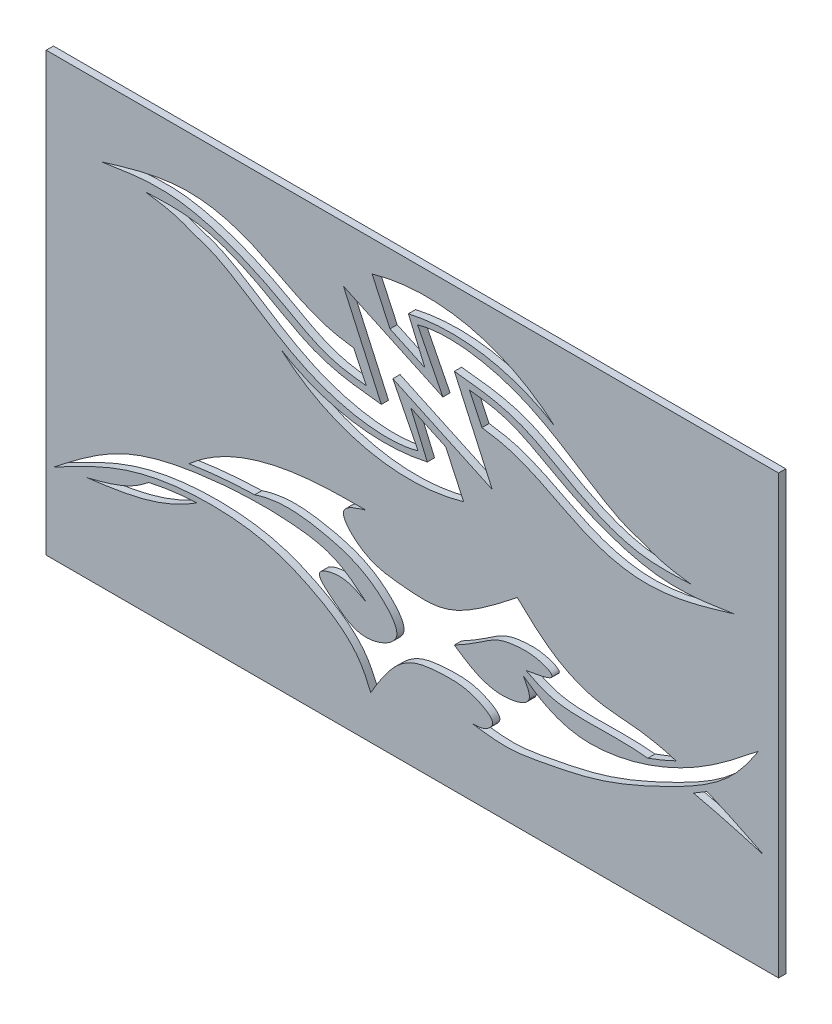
ISO-10303-21;
HEADER;
FILE_DESCRIPTION(('STEP AP214'),'2;1');
FILE_NAME('part.step','',(''),(''),'','','');
FILE_SCHEMA(('AUTOMOTIVE_DESIGN { 1 0 10303 214 1 1 1 1 }'));
ENDSEC;
DATA;
#1=APPLICATION_CONTEXT('core data for automotive mechanical design processes');
#2=APPLICATION_PROTOCOL_DEFINITION('international standard','automotive_design',2000,#1);
#3=PRODUCT_CONTEXT('',#1,'mechanical');
#4=PRODUCT('Part','Part','',(#3));
#5=PRODUCT_RELATED_PRODUCT_CATEGORY('part','',(#4));
#6=PRODUCT_DEFINITION_FORMATION('','',#4);
#7=PRODUCT_DEFINITION_CONTEXT('part definition',#1,'design');
#8=PRODUCT_DEFINITION('design','',#6,#7);
#9=PRODUCT_DEFINITION_SHAPE('','',#8);
#10=(LENGTH_UNIT() NAMED_UNIT(*) SI_UNIT(.MILLI.,.METRE.));
#11=(NAMED_UNIT(*) PLANE_ANGLE_UNIT() SI_UNIT($,.RADIAN.));
#12=(NAMED_UNIT(*) SI_UNIT($,.STERADIAN.) SOLID_ANGLE_UNIT());
#13=UNCERTAINTY_MEASURE_WITH_UNIT(LENGTH_MEASURE(1.E-05),#10,'distance_accuracy_value','');
#14=(GEOMETRIC_REPRESENTATION_CONTEXT(3) GLOBAL_UNCERTAINTY_ASSIGNED_CONTEXT((#13)) GLOBAL_UNIT_ASSIGNED_CONTEXT((#10,
#11,#12)) REPRESENTATION_CONTEXT('',''));
#15=CARTESIAN_POINT('',(0.,0.,0.));
#16=DIRECTION('',(0.,0.,1.));
#17=DIRECTION('',(1.,0.,0.));
#18=AXIS2_PLACEMENT_3D('',#15,#16,#17);
#19=CARTESIAN_POINT('',(0.,60.6222483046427,1.));
#20=DIRECTION('',(0.,0.,-1.));
#21=DIRECTION('',(-1.,0.,0.));
#22=AXIS2_PLACEMENT_3D('',#19,#20,#21);
#23=PLANE('',#22);
#24=CARTESIAN_POINT('',(-6.27922089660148,6.32670849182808,1.));
#25=CARTESIAN_POINT('',(-4.13743444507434,7.47239618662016,1.));
#26=CARTESIAN_POINT('',(0.153197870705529,9.7546316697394,1.));
#27=CARTESIAN_POINT('',(5.48119120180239,12.653125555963,1.));
#28=CARTESIAN_POINT('',(9.81810429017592,14.5604663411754,1.));
#29=CARTESIAN_POINT('',(14.2891398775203,16.0020643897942,1.));
#30=CARTESIAN_POINT('',(19.0150714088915,16.7074066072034,1.));
#31=CARTESIAN_POINT('',(23.8138201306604,16.7876979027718,1.));
#32=CARTESIAN_POINT('',(27.3850805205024,16.5440429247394,1.));
#33=CARTESIAN_POINT('',(30.8425096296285,15.9014372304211,1.));
#34=CARTESIAN_POINT('',(34.1330189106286,14.7658977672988,1.));
#35=CARTESIAN_POINT('',(37.3802569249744,13.1957705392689,1.));
#36=CARTESIAN_POINT('',(39.9547778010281,11.593569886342,1.));
#37=CARTESIAN_POINT('',(41.6779569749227,10.066337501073,1.));
#38=CARTESIAN_POINT('',(42.7600906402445,8.78986636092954,1.));
#39=CARTESIAN_POINT('',(43.5765310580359,7.35046126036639,1.));
#40=CARTESIAN_POINT('',(44.0575067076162,6.2313293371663,1.));
#41=CARTESIAN_POINT('',(44.2921022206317,5.68562981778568,1.));
#42=B_SPLINE_CURVE_WITH_KNOTS('',3,(#24,#25,#26,#27,#28,#29,#30,#31,#32,#33,#34,#35,#36,#37,#38,
#39,#40,#41),.UNSPECIFIED.,.F.,.F.,(4,1,1,1,1,1,1,1,1,1,1,1,1,1,1,4),(0.,0.146902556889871,
0.293805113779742,0.367256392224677,0.440707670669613,0.587610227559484,0.661061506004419,
0.734512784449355,0.80796406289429,0.881415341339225,0.954866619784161,1.0283178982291,
1.06504353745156,1.10176917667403,1.1384948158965,1.17522045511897),.UNSPECIFIED.);
#43=CARTESIAN_POINT('',(14.2141676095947,15.8309355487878,1.));
#44=VERTEX_POINT('',#43);
#45=CARTESIAN_POINT('',(20.8849218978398,16.7101497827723,1.));
#46=VERTEX_POINT('',#45);
#47=EDGE_CURVE('E1598',#44,#46,#42,.T.);
#48=ORIENTED_EDGE('',*,*,#47,.T.);
#49=CARTESIAN_POINT('',(22.0256733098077,17.4946301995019,1.));
#50=CARTESIAN_POINT('',(21.5850929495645,17.1788387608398,1.));
#51=CARTESIAN_POINT('',(19.2058350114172,15.5353742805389,1.));
#52=CARTESIAN_POINT('',(13.8139596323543,13.1953279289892,1.));
#53=CARTESIAN_POINT('',(8.58356091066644,12.5139913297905,1.));
#54=CARTESIAN_POINT('',(5.67789014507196,12.1354848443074,1.));
#55=B_SPLINE_CURVE_WITH_KNOTS('',3,(#49,#50,#51,#52,#53,#54),.UNSPECIFIED.,.F.,.F.,(4,1,1,4),
(0.743291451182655,0.767152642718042,0.870645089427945,1.),.UNSPECIFIED.);
#56=CARTESIAN_POINT('',(5.67789014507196,12.1354848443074,1.));
#57=VERTEX_POINT('',#56);
#58=EDGE_CURVE('E1612',#46,#57,#55,.T.);
#59=ORIENTED_EDGE('',*,*,#58,.T.);
#60=CARTESIAN_POINT('',(15.3762407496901,16.8374123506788,1.));
#61=CARTESIAN_POINT('',(14.4481218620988,15.9943135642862,1.));
#62=CARTESIAN_POINT('',(11.6429020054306,13.6606811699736,1.));
#63=CARTESIAN_POINT('',(8.04659774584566,12.7411406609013,1.));
#64=CARTESIAN_POINT('',(5.67789014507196,12.1354848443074,1.));
#65=B_SPLINE_CURVE_WITH_KNOTS('',3,(#60,#61,#62,#63,#64),.UNSPECIFIED.,.F.,.F.,(4,1,4),
(0.744816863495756,0.831923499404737,1.),.UNSPECIFIED.);
#66=EDGE_CURVE('E1604',#44,#57,#65,.T.);
#67=ORIENTED_EDGE('',*,*,#66,.F.);
#68=EDGE_LOOP('',(#48,#59,#67));
#69=FACE_BOUND('',#68,.T.);
#70=DIRECTION('',(0.,-1.,0.));
#71=VECTOR('',#70,1.);
#72=CARTESIAN_POINT('',(0.,0.,1.));
#73=LINE('',#72,#71);
#74=CARTESIAN_POINT('',(0.,60.6222483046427,1.));
#75=VERTEX_POINT('',#74);
#76=CARTESIAN_POINT('',(0.,0.,1.));
#77=VERTEX_POINT('',#76);
#78=EDGE_CURVE('E1055',#75,#77,#73,.T.);
#79=ORIENTED_EDGE('',*,*,#78,.T.);
#80=DIRECTION('',(1.,0.,0.));
#81=VECTOR('',#80,1.);
#82=CARTESIAN_POINT('',(0.,0.,1.));
#83=LINE('',#82,#81);
#84=CARTESIAN_POINT('',(101.515362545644,0.,1.));
#85=VERTEX_POINT('',#84);
#86=EDGE_CURVE('E1058',#77,#85,#83,.T.);
#87=ORIENTED_EDGE('',*,*,#86,.T.);
#88=DIRECTION('',(0.,1.,0.));
#89=VECTOR('',#88,1.);
#90=CARTESIAN_POINT('',(101.515362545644,0.,1.));
#91=LINE('',#90,#89);
#92=CARTESIAN_POINT('',(101.515362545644,60.6222483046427,1.));
#93=VERTEX_POINT('',#92);
#94=EDGE_CURVE('E1060',#85,#93,#91,.T.);
#95=ORIENTED_EDGE('',*,*,#94,.T.);
#96=DIRECTION('',(-1.,0.,0.));
#97=VECTOR('',#96,1.);
#98=CARTESIAN_POINT('',(0.,60.6222483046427,1.));
#99=LINE('',#98,#97);
#100=EDGE_CURVE('E1062',#93,#75,#99,.T.);
#101=ORIENTED_EDGE('',*,*,#100,.T.);
#102=EDGE_LOOP('',(#79,#87,#95,#101));
#103=FACE_BOUND('',#102,.T.);
#104=CARTESIAN_POINT('',(50.3419162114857,61.3011281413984,1.));
#105=DIRECTION('',(0.,0.,1.));
#106=DIRECTION('',(1.,0.,0.));
#107=AXIS2_PLACEMENT_3D('',#104,#105,#106);
#108=CIRCLE('',#107,27.0255193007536);
#109=CARTESIAN_POINT('',(32.5738210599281,40.9375948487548,1.));
#110=VERTEX_POINT('',#109);
#111=CARTESIAN_POINT('',(57.860331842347,35.3424663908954,1.));
#112=VERTEX_POINT('',#111);
#113=EDGE_CURVE('E1008',#110,#112,#108,.T.);
#114=ORIENTED_EDGE('',*,*,#113,.F.);
#115=CARTESIAN_POINT('',(46.839862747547,64.3670125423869,1.));
#116=DIRECTION('',(0.,0.,-1.));
#117=DIRECTION('',(-1.,0.,0.));
#118=AXIS2_PLACEMENT_3D('',#115,#116,#117);
#119=CIRCLE('',#118,27.4309598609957);
#120=CARTESIAN_POINT('',(52.8290535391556,37.5978670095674,1.));
#121=VERTEX_POINT('',#120);
#122=EDGE_CURVE('E988',#121,#110,#119,.T.);
#123=ORIENTED_EDGE('',*,*,#122,.F.);
#124=DIRECTION('',(0.394124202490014,-0.919057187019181,0.));
#125=VECTOR('',#124,1.);
#126=CARTESIAN_POINT('',(52.8290535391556,37.5978670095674,1.));
#127=LINE('',#126,#125);
#128=CARTESIAN_POINT('',(50.5345678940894,42.9483720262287,1.));
#129=VERTEX_POINT('',#128);
#130=EDGE_CURVE('E1017',#129,#121,#127,.T.);
#131=ORIENTED_EDGE('',*,*,#130,.F.);
#132=DIRECTION('',(-0.906550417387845,0.422097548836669,0.));
#133=VECTOR('',#132,1.);
#134=CARTESIAN_POINT('',(50.5345678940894,42.9483720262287,1.));
#135=LINE('',#134,#133);
#136=CARTESIAN_POINT('',(55.3803474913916,40.692136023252,1.));
#137=VERTEX_POINT('',#136);
#138=EDGE_CURVE('E1014',#137,#129,#135,.T.);
#139=ORIENTED_EDGE('',*,*,#138,.F.);
#140=DIRECTION('',(-0.420582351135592,0.907254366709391,0.));
#141=VECTOR('',#140,1.);
#142=CARTESIAN_POINT('',(57.860331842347,35.3424663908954,1.));
#143=LINE('',#142,#141);
#144=EDGE_CURVE('E1011',#112,#137,#143,.T.);
#145=ORIENTED_EDGE('',*,*,#144,.F.);
#146=EDGE_LOOP('',(#114,#123,#131,#139,#145));
#147=FACE_BOUND('',#146,.T.);
#148=CARTESIAN_POINT('',(13.7108647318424,50.4840116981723,1.));
#149=CARTESIAN_POINT('',(19.0978077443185,49.8049852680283,1.));
#150=CARTESIAN_POINT('',(19.0962696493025,49.1082469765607,1.));
#151=CARTESIAN_POINT('',(25.5647703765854,47.4141158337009,1.));
#152=CARTESIAN_POINT('',(34.8517864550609,38.6541827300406,1.));
#153=CARTESIAN_POINT('',(47.7278202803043,37.1494424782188,1.));
#154=CARTESIAN_POINT('',(51.5495474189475,38.3048483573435,1.));
#155=B_SPLINE_CURVE_WITH_KNOTS('',3,(#148,#149,#150,#151,#152,#153,#154),.UNSPECIFIED.,.F.,.F.,
(4,2,1,4),(0.,0.186374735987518,0.634082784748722,1.),.UNSPECIFIED.);
#156=CARTESIAN_POINT('',(13.7108647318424,50.4840116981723,1.));
#157=VERTEX_POINT('',#156);
#158=CARTESIAN_POINT('',(51.5495474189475,38.3048483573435,1.));
#159=VERTEX_POINT('',#158);
#160=EDGE_CURVE('E1199',#157,#159,#155,.T.);
#161=ORIENTED_EDGE('',*,*,#160,.F.);
#162=CARTESIAN_POINT('',(46.4488721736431,41.3236153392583,1.));
#163=CARTESIAN_POINT('',(43.5280923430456,41.6331413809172,1.));
#164=CARTESIAN_POINT('',(37.8024770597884,42.2399064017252,1.));
#165=CARTESIAN_POINT('',(29.8871743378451,47.1938334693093,1.));
#166=CARTESIAN_POINT('',(21.8343272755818,50.8447688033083,1.));
#167=CARTESIAN_POINT('',(15.9694833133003,50.5843153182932,1.));
#168=CARTESIAN_POINT('',(13.7108647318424,50.4840116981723,1.));
#169=B_SPLINE_CURVE_WITH_KNOTS('',3,(#162,#163,#164,#165,#166,#167,#168),.UNSPECIFIED.,.F.,.F.,
(4,1,1,1,4),(0.,0.251908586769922,0.493817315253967,0.805063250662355,1.),.UNSPECIFIED.);
#170=CARTESIAN_POINT('',(46.4488721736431,41.3236153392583,1.));
#171=VERTEX_POINT('',#170);
#172=EDGE_CURVE('E1233',#171,#157,#169,.T.);
#173=ORIENTED_EDGE('',*,*,#172,.F.);
#174=DIRECTION('',(0.413039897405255,-0.910712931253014,0.));
#175=VECTOR('',#174,1.);
#176=CARTESIAN_POINT('',(46.4488721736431,41.3236153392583,1.));
#177=LINE('',#176,#175);
#178=CARTESIAN_POINT('',(41.2026368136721,52.8910557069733,1.));
#179=VERTEX_POINT('',#178);
#180=EDGE_CURVE('E1148',#179,#171,#177,.T.);
#181=ORIENTED_EDGE('',*,*,#180,.F.);
#182=DIRECTION('',(-0.906550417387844,0.42209754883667,0.));
#183=VECTOR('',#182,1.);
#184=CARTESIAN_POINT('',(54.9853392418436,46.4737127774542,1.));
#185=LINE('',#184,#183);
#186=CARTESIAN_POINT('',(54.9853392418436,46.4737127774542,1.));
#187=VERTEX_POINT('',#186);
#188=EDGE_CURVE('E1189',#187,#179,#185,.T.);
#189=ORIENTED_EDGE('',*,*,#188,.F.);
#190=DIRECTION('',(0.452613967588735,-0.891706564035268,0.));
#191=VECTOR('',#190,1.);
#192=CARTESIAN_POINT('',(51.4798812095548,53.379906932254,1.));
#193=LINE('',#192,#191);
#194=CARTESIAN_POINT('',(51.4798812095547,53.379906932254,1.));
#195=VERTEX_POINT('',#194);
#196=EDGE_CURVE('E1219',#195,#187,#193,.T.);
#197=ORIENTED_EDGE('',*,*,#196,.F.);
#198=CARTESIAN_POINT('',(89.3185638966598,41.2007435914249,1.));
#199=CARTESIAN_POINT('',(83.9316208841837,41.879770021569,1.));
#200=CARTESIAN_POINT('',(83.9331589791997,42.5765083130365,1.));
#201=CARTESIAN_POINT('',(77.4646582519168,44.2706394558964,1.));
#202=CARTESIAN_POINT('',(68.1776421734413,53.0305725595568,1.));
#203=CARTESIAN_POINT('',(55.3016083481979,54.5353128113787,1.));
#204=CARTESIAN_POINT('',(51.4798812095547,53.379906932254,1.));
#205=B_SPLINE_CURVE_WITH_KNOTS('',3,(#198,#199,#200,#201,#202,#203,#204),.UNSPECIFIED.,.F.,.F.,
(4,2,1,4),(0.,0.186374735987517,0.634082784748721,1.),.UNSPECIFIED.);
#206=CARTESIAN_POINT('',(89.3185638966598,41.2007435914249,1.));
#207=VERTEX_POINT('',#206);
#208=EDGE_CURVE('E1182',#207,#195,#205,.T.);
#209=ORIENTED_EDGE('',*,*,#208,.F.);
#210=CARTESIAN_POINT('',(56.5805564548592,50.3611399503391,1.));
#211=CARTESIAN_POINT('',(59.5013362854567,50.0516139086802,1.));
#212=CARTESIAN_POINT('',(65.2269515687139,49.4448488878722,1.));
#213=CARTESIAN_POINT('',(73.1422542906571,44.490921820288,1.));
#214=CARTESIAN_POINT('',(81.1951013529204,40.8399864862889,1.));
#215=CARTESIAN_POINT('',(87.0599453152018,41.100439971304,1.));
#216=CARTESIAN_POINT('',(89.3185638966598,41.2007435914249,1.));
#217=B_SPLINE_CURVE_WITH_KNOTS('',3,(#210,#211,#212,#213,#214,#215,#216),.UNSPECIFIED.,.F.,.F.,
(4,1,1,1,4),(0.,0.251908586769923,0.493817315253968,0.805063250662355,1.),.UNSPECIFIED.);
#218=CARTESIAN_POINT('',(56.5805564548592,50.3611399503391,1.));
#219=VERTEX_POINT('',#218);
#220=EDGE_CURVE('E1178',#219,#207,#217,.T.);
#221=ORIENTED_EDGE('',*,*,#220,.F.);
#222=DIRECTION('',(-0.413039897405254,0.910712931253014,0.));
#223=VECTOR('',#222,1.);
#224=CARTESIAN_POINT('',(56.5805564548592,50.3611399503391,1.));
#225=LINE('',#224,#223);
#226=CARTESIAN_POINT('',(61.8267918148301,38.7936995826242,1.));
#227=VERTEX_POINT('',#226);
#228=EDGE_CURVE('E1214',#227,#219,#225,.T.);
#229=ORIENTED_EDGE('',*,*,#228,.F.);
#230=DIRECTION('',(0.906550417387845,-0.422097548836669,0.));
#231=VECTOR('',#230,1.);
#232=CARTESIAN_POINT('',(48.0440893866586,45.2110425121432,1.));
#233=LINE('',#232,#231);
#234=CARTESIAN_POINT('',(48.0440893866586,45.2110425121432,1.));
#235=VERTEX_POINT('',#234);
#236=EDGE_CURVE('E1210',#235,#227,#233,.T.);
#237=ORIENTED_EDGE('',*,*,#236,.F.);
#238=DIRECTION('',(-0.452613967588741,0.891706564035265,0.));
#239=VECTOR('',#238,1.);
#240=CARTESIAN_POINT('',(51.5495474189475,38.3048483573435,1.));
#241=LINE('',#240,#239);
#242=EDGE_CURVE('E1204',#159,#235,#241,.T.);
#243=ORIENTED_EDGE('',*,*,#242,.F.);
#244=EDGE_LOOP('',(#161,#173,#181,#189,#197,#209,#221,#229,#237,#243));
#245=FACE_BOUND('',#244,.T.);
#246=DIRECTION('',(-0.427326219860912,0.904097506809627,0.));
#247=VECTOR('',#246,1.);
#248=CARTESIAN_POINT('',(44.3669639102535,42.5207125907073,1.));
#249=LINE('',#248,#247);
#250=CARTESIAN_POINT('',(44.3669639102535,42.5207125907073,1.));
#251=VERTEX_POINT('',#250);
#252=CARTESIAN_POINT('',(42.6367947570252,46.1812453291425,1.));
#253=VERTEX_POINT('',#252);
#254=EDGE_CURVE('E906',#251,#253,#249,.T.);
#255=ORIENTED_EDGE('',*,*,#254,.F.);
#256=CARTESIAN_POINT('',(7.67333076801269,51.0565364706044,1.));
#257=CARTESIAN_POINT('',(10.9058647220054,51.5601887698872,1.));
#258=CARTESIAN_POINT('',(16.4928579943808,52.4306829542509,1.));
#259=CARTESIAN_POINT('',(24.7823921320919,50.4681028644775,1.));
#260=CARTESIAN_POINT('',(32.1561433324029,47.1637810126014,1.));
#261=CARTESIAN_POINT('',(38.4207476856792,43.1880557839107,1.));
#262=CARTESIAN_POINT('',(42.8813385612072,42.6874441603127,1.));
#263=CARTESIAN_POINT('',(44.3669639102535,42.5207125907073,1.));
#264=B_SPLINE_CURVE_WITH_KNOTS('',3,(#256,#257,#258,#259,#260,#261,#262,#263),.UNSPECIFIED.,.F.,
.F.,(4,1,1,1,1,4),(0.,0.252362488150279,0.436174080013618,0.653000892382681,0.884429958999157,
1.),.UNSPECIFIED.);
#265=CARTESIAN_POINT('',(7.67333076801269,51.0565364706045,1.));
#266=VERTEX_POINT('',#265);
#267=EDGE_CURVE('E894',#266,#251,#264,.T.);
#268=ORIENTED_EDGE('',*,*,#267,.F.);
#269=CARTESIAN_POINT('',(42.6367947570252,46.1812453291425,1.));
#270=CARTESIAN_POINT('',(41.7447040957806,46.3087770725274,1.));
#271=CARTESIAN_POINT('',(38.5068173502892,46.771659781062,1.));
#272=CARTESIAN_POINT('',(33.61446116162,48.9878387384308,1.));
#273=CARTESIAN_POINT('',(27.7105214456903,52.2074124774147,1.));
#274=CARTESIAN_POINT('',(18.8348211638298,54.4378386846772,1.));
#275=CARTESIAN_POINT('',(12.0979129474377,52.3969353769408,1.));
#276=CARTESIAN_POINT('',(7.67333076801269,51.0565364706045,1.));
#277=B_SPLINE_CURVE_WITH_KNOTS('',3,(#269,#270,#271,#272,#273,#274,#275,#276),.UNSPECIFIED.,.F.,
.F.,(4,1,1,1,1,4),(0.,0.0739366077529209,0.268356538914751,0.435017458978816,0.628937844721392,
1.),.UNSPECIFIED.);
#278=EDGE_CURVE('E912',#253,#266,#277,.T.);
#279=ORIENTED_EDGE('',*,*,#278,.F.);
#280=EDGE_LOOP('',(#255,#268,#279));
#281=FACE_BOUND('',#280,.T.);
#282=CARTESIAN_POINT('',(52.6875124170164,30.3836271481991,1.));
#283=DIRECTION('',(0.,0.,1.));
#284=DIRECTION('',(1.,0.,0.));
#285=AXIS2_PLACEMENT_3D('',#282,#283,#284);
#286=CIRCLE('',#285,27.0255193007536);
#287=CARTESIAN_POINT('',(70.4556075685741,50.7471604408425,1.));
#288=VERTEX_POINT('',#287);
#289=CARTESIAN_POINT('',(45.1690967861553,56.3422888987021,1.));
#290=VERTEX_POINT('',#289);
#291=EDGE_CURVE('E864',#288,#290,#286,.T.);
#292=ORIENTED_EDGE('',*,*,#291,.F.);
#293=CARTESIAN_POINT('',(56.1895658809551,27.3177427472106,1.));
#294=DIRECTION('',(0.,0.,-1.));
#295=DIRECTION('',(-1.,0.,0.));
#296=AXIS2_PLACEMENT_3D('',#293,#294,#295);
#297=CIRCLE('',#296,27.4309598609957);
#298=CARTESIAN_POINT('',(50.2003750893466,54.0868882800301,1.));
#299=VERTEX_POINT('',#298);
#300=EDGE_CURVE('E858',#299,#288,#297,.T.);
#301=ORIENTED_EDGE('',*,*,#300,.F.);
#302=DIRECTION('',(-0.394124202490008,0.919057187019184,0.));
#303=VECTOR('',#302,1.);
#304=CARTESIAN_POINT('',(50.2003750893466,54.0868882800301,1.));
#305=LINE('',#304,#303);
#306=CARTESIAN_POINT('',(52.4948607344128,48.7363832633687,1.));
#307=VERTEX_POINT('',#306);
#308=EDGE_CURVE('E873',#307,#299,#305,.T.);
#309=ORIENTED_EDGE('',*,*,#308,.F.);
#310=DIRECTION('',(0.906550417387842,-0.422097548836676,0.));
#311=VECTOR('',#310,1.);
#312=CARTESIAN_POINT('',(52.4948607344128,48.7363832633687,1.));
#313=LINE('',#312,#311);
#314=CARTESIAN_POINT('',(47.6490811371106,50.9926192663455,1.));
#315=VERTEX_POINT('',#314);
#316=EDGE_CURVE('E870',#315,#307,#313,.T.);
#317=ORIENTED_EDGE('',*,*,#316,.F.);
#318=DIRECTION('',(0.420582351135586,-0.907254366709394,0.));
#319=VECTOR('',#318,1.);
#320=CARTESIAN_POINT('',(45.1690967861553,56.3422888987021,1.));
#321=LINE('',#320,#319);
#322=EDGE_CURVE('E867',#290,#315,#321,.T.);
#323=ORIENTED_EDGE('',*,*,#322,.F.);
#324=EDGE_LOOP('',(#292,#301,#309,#317,#323));
#325=FACE_BOUND('',#324,.T.);
#326=DIRECTION('',(0.427326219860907,-0.90409750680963,0.));
#327=VECTOR('',#326,1.);
#328=CARTESIAN_POINT('',(58.6624647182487,49.1640426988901,1.));
#329=LINE('',#328,#327);
#330=CARTESIAN_POINT('',(58.6624647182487,49.1640426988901,1.));
#331=VERTEX_POINT('',#330);
#332=CARTESIAN_POINT('',(60.392633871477,45.5035099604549,1.));
#333=VERTEX_POINT('',#332);
#334=EDGE_CURVE('E1300',#331,#333,#329,.T.);
#335=ORIENTED_EDGE('',*,*,#334,.F.);
#336=CARTESIAN_POINT('',(95.3560978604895,40.6282188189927,1.));
#337=CARTESIAN_POINT('',(92.1235639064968,40.12456651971,1.));
#338=CARTESIAN_POINT('',(86.5365706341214,39.2540723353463,1.));
#339=CARTESIAN_POINT('',(78.2470364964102,41.2166524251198,1.));
#340=CARTESIAN_POINT('',(70.8732852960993,44.5209742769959,1.));
#341=CARTESIAN_POINT('',(64.608680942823,48.4966995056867,1.));
#342=CARTESIAN_POINT('',(60.148090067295,48.9973111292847,1.));
#343=CARTESIAN_POINT('',(58.6624647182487,49.1640426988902,1.));
#344=B_SPLINE_CURVE_WITH_KNOTS('',3,(#336,#337,#338,#339,#340,#341,#342,#343),.UNSPECIFIED.,.F.,
.F.,(4,1,1,1,1,4),(0.,0.252362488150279,0.436174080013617,0.653000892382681,0.884429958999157,
1.),.UNSPECIFIED.);
#345=CARTESIAN_POINT('',(95.3560978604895,40.6282188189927,1.));
#346=VERTEX_POINT('',#345);
#347=EDGE_CURVE('E1306',#346,#331,#344,.T.);
#348=ORIENTED_EDGE('',*,*,#347,.F.);
#349=CARTESIAN_POINT('',(60.392633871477,45.5035099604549,1.));
#350=CARTESIAN_POINT('',(61.2847245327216,45.37597821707,1.));
#351=CARTESIAN_POINT('',(64.5226112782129,44.9130955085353,1.));
#352=CARTESIAN_POINT('',(69.4149674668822,42.6969165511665,1.));
#353=CARTESIAN_POINT('',(75.3189071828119,39.4773428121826,1.));
#354=CARTESIAN_POINT('',(84.1946074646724,37.24691660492,1.));
#355=CARTESIAN_POINT('',(90.9315156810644,39.2878199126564,1.));
#356=CARTESIAN_POINT('',(95.3560978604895,40.6282188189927,1.));
#357=B_SPLINE_CURVE_WITH_KNOTS('',3,(#349,#350,#351,#352,#353,#354,#355,#356),.UNSPECIFIED.,.F.,
.F.,(4,1,1,1,1,4),(0.,0.0739366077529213,0.268356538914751,0.435017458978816,0.628937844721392,
1.),.UNSPECIFIED.);
#358=EDGE_CURVE('E1292',#333,#346,#357,.T.);
#359=ORIENTED_EDGE('',*,*,#358,.F.);
#360=EDGE_LOOP('',(#335,#348,#359));
#361=FACE_BOUND('',#360,.T.);
#362=CARTESIAN_POINT('',(44.7804233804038,17.1552223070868,1.));
#363=CARTESIAN_POINT('',(44.3273605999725,17.5341789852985,1.));
#364=CARTESIAN_POINT('',(43.4253982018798,18.288310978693,1.));
#365=CARTESIAN_POINT('',(41.980934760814,19.3618462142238,1.));
#366=CARTESIAN_POINT('',(40.3843699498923,20.2626561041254,1.));
#367=CARTESIAN_POINT('',(38.0826013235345,21.0725821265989,1.));
#368=CARTESIAN_POINT('',(35.0728665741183,21.5229933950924,1.));
#369=CARTESIAN_POINT('',(31.548242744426,21.7254507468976,1.));
#370=CARTESIAN_POINT('',(28.0569139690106,21.707396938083,1.));
#371=CARTESIAN_POINT('',(24.5848396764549,21.4811352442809,1.));
#372=CARTESIAN_POINT('',(21.0984451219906,21.1005651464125,1.));
#373=CARTESIAN_POINT('',(16.432650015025,20.3402835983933,1.));
#374=CARTESIAN_POINT('',(10.7174652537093,18.7141650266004,1.));
#375=CARTESIAN_POINT('',(4.71107242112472,14.9907061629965,1.));
#376=CARTESIAN_POINT('',(-0.764813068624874,10.614623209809,1.));
#377=CARTESIAN_POINT('',(-4.44341964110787,7.76135692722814,1.));
#378=CARTESIAN_POINT('',(-6.27922089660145,6.32670849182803,1.));
#379=B_SPLINE_CURVE_WITH_KNOTS('',3,(#362,#363,#364,#365,#366,#367,#368,#369,#370,#371,#372,
#373,#374,#375,#376,#377,#378),.UNSPECIFIED.,.F.,.F.,(4,1,1,1,1,1,1,1,1,1,1,1,1,1,4),(0.,
0.0370013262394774,0.0740026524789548,0.111003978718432,0.14800530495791,0.222007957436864,
0.296010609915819,0.370013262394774,0.444015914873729,0.518018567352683,0.592021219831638,
0.740026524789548,0.888031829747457,1.03603713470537,1.18404243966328),.UNSPECIFIED.);
#380=CARTESIAN_POINT('',(28.8966302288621,21.6959951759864,1.));
#381=VERTEX_POINT('',#380);
#382=CARTESIAN_POINT('',(19.7860274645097,20.8766362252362,1.));
#383=VERTEX_POINT('',#382);
#384=EDGE_CURVE('E697',#381,#383,#379,.T.);
#385=ORIENTED_EDGE('',*,*,#384,.T.);
#386=CARTESIAN_POINT('',(44.2992334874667,27.5603108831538,1.));
#387=CARTESIAN_POINT('',(41.5071965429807,27.5488090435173,1.));
#388=CARTESIAN_POINT('',(34.0916293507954,27.5182604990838,1.));
#389=CARTESIAN_POINT('',(24.8300108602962,25.0729744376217,1.));
#390=CARTESIAN_POINT('',(19.9905911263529,21.0848968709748,1.));
#391=CARTESIAN_POINT('',(18.7572000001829,19.9777363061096,1.));
#392=B_SPLINE_CURVE_WITH_KNOTS('',3,(#386,#387,#388,#389,#390,#391),.UNSPECIFIED.,.F.,.F.,(4,1,
1,4),(0.,0.196585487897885,0.522125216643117,0.637922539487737),.UNSPECIFIED.);
#393=CARTESIAN_POINT('',(44.2992334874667,27.5603108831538,1.));
#394=VERTEX_POINT('',#393);
#395=EDGE_CURVE('E802',#394,#383,#392,.T.);
#396=ORIENTED_EDGE('',*,*,#395,.F.);
#397=CARTESIAN_POINT('',(65.2993314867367,27.5603108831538,1.));
#398=CARTESIAN_POINT('',(63.574191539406,26.2021644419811,1.));
#399=CARTESIAN_POINT('',(60.2463191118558,23.5822389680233,1.));
#400=CARTESIAN_POINT('',(54.9170126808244,20.5321556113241,1.));
#401=CARTESIAN_POINT('',(48.9012575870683,21.0571856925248,1.));
#402=CARTESIAN_POINT('',(44.2536312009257,21.4932369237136,1.));
#403=CARTESIAN_POINT('',(39.8803292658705,26.202745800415,1.));
#404=CARTESIAN_POINT('',(42.849125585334,27.114812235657,1.));
#405=CARTESIAN_POINT('',(44.2992334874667,27.5603108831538,1.));
#406=B_SPLINE_CURVE_WITH_KNOTS('',3,(#397,#398,#399,#400,#401,#402,#403,#404,#405),
.UNSPECIFIED.,.F.,.F.,(4,1,1,1,1,1,4),(0.,0.211784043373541,0.408540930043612,0.565788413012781,
0.768992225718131,0.887164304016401,1.),.UNSPECIFIED.);
#407=CARTESIAN_POINT('',(65.2993314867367,27.5603108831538,1.));
#408=VERTEX_POINT('',#407);
#409=EDGE_CURVE('E794',#408,#394,#406,.T.);
#410=ORIENTED_EDGE('',*,*,#409,.F.);
#411=CARTESIAN_POINT('',(65.2993314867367,27.5603108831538,1.));
#412=CARTESIAN_POINT('',(66.8348697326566,26.0939689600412,1.));
#413=CARTESIAN_POINT('',(69.9819982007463,23.0886602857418,1.));
#414=CARTESIAN_POINT('',(75.8559230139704,20.3867785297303,1.));
#415=CARTESIAN_POINT('',(82.2817094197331,20.3098596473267,1.));
#416=CARTESIAN_POINT('',(86.2515528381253,19.3353047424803,1.));
#417=CARTESIAN_POINT('',(88.3418786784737,18.64130993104,1.));
#418=B_SPLINE_CURVE_WITH_KNOTS('',3,(#411,#412,#413,#414,#415,#416,#417),.UNSPECIFIED.,.F.,.F.,
(4,1,1,1,4),(0.,0.1696339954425,0.347669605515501,0.50082682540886,0.677837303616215),.UNSPECIFIED.);
#419=CARTESIAN_POINT('',(87.3177379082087,18.9662476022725,1.));
#420=VERTEX_POINT('',#419);
#421=EDGE_CURVE('E786',#408,#420,#418,.T.);
#422=ORIENTED_EDGE('',*,*,#421,.T.);
#423=CARTESIAN_POINT('',(102.154334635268,29.5383631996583,1.));
#424=CARTESIAN_POINT('',(100.813797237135,28.463423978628,1.));
#425=CARTESIAN_POINT('',(98.1289860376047,26.3096788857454,1.));
#426=CARTESIAN_POINT('',(94.1241772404,23.1022741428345,1.));
#427=CARTESIAN_POINT('',(89.9462327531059,20.253393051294,1.));
#428=CARTESIAN_POINT('',(85.4231139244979,17.9785327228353,1.));
#429=CARTESIAN_POINT('',(81.4124170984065,16.6206399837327,1.));
#430=CARTESIAN_POINT('',(78.132219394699,15.993049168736,1.));
#431=CARTESIAN_POINT('',(75.6392280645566,15.7715449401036,1.));
#432=CARTESIAN_POINT('',(73.2228526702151,15.9330955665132,1.));
#433=CARTESIAN_POINT('',(70.8371788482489,16.6071845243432,1.));
#434=CARTESIAN_POINT('',(68.6772967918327,17.7044752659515,1.));
#435=CARTESIAN_POINT('',(67.2760397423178,18.6873679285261,1.));
#436=CARTESIAN_POINT('',(66.5857715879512,19.1696412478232,1.));
#437=B_SPLINE_CURVE_WITH_KNOTS('',3,(#423,#424,#425,#426,#427,#428,#429,#430,#431,#432,#433,
#434,#435,#436),.UNSPECIFIED.,.F.,.F.,(4,1,1,1,1,1,1,1,1,1,1,4),(-0.137052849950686,
0.00507875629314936,0.147210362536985,0.289341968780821,0.431473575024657,0.573605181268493,
0.64467098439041,0.715736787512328,0.786802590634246,0.857868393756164,0.928934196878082,1.),.UNSPECIFIED.);
#438=CARTESIAN_POINT('',(83.3921432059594,17.327029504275,1.));
#439=VERTEX_POINT('',#438);
#440=EDGE_CURVE('E778',#420,#439,#437,.T.);
#441=ORIENTED_EDGE('',*,*,#440,.T.);
#442=CARTESIAN_POINT('',(66.5209071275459,19.4164732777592,1.));
#443=CARTESIAN_POINT('',(67.454756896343,18.9368209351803,1.));
#444=CARTESIAN_POINT('',(69.982265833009,17.6386189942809,1.));
#445=CARTESIAN_POINT('',(75.0010349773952,17.4091310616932,1.));
#446=CARTESIAN_POINT('',(80.2350595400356,17.6340804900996,1.));
#447=CARTESIAN_POINT('',(83.6637609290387,17.3194377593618,1.));
#448=CARTESIAN_POINT('',(85.0291415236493,17.1360474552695,1.));
#449=B_SPLINE_CURVE_WITH_KNOTS('',3,(#442,#443,#444,#445,#446,#447,#448),.UNSPECIFIED.,.F.,.F.,
(4,1,1,1,4),(0.,0.092779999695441,0.251113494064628,0.436847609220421,0.560371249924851),.UNSPECIFIED.);
#450=CARTESIAN_POINT('',(66.5209071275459,19.4164732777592,1.));
#451=VERTEX_POINT('',#450);
#452=EDGE_CURVE('E770',#451,#439,#449,.T.);
#453=ORIENTED_EDGE('',*,*,#452,.F.);
#454=CARTESIAN_POINT('',(66.5209071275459,19.4164732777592,1.));
#455=CARTESIAN_POINT('',(68.3211263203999,19.7232162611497,1.));
#456=CARTESIAN_POINT('',(72.0705879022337,20.3620945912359,1.));
#457=CARTESIAN_POINT('',(68.0372845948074,21.8035249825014,1.));
#458=CARTESIAN_POINT('',(61.5625098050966,21.5876991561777,1.));
#459=CARTESIAN_POINT('',(61.8636766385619,20.2973820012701,1.));
#460=CARTESIAN_POINT('',(56.5737911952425,17.4968544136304,1.));
#461=B_SPLINE_CURVE_WITH_KNOTS('',3,(#454,#455,#456,#457,#458,#459,#460),.UNSPECIFIED.,.F.,.F.,
(4,1,2,4),(0.,0.204947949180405,0.426861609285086,1.),.UNSPECIFIED.);
#462=CARTESIAN_POINT('',(56.5737911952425,17.4968544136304,1.));
#463=VERTEX_POINT('',#462);
#464=EDGE_CURVE('E762',#451,#463,#461,.T.);
#465=ORIENTED_EDGE('',*,*,#464,.T.);
#466=CARTESIAN_POINT('',(66.156221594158,18.5548349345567,1.));
#467=CARTESIAN_POINT('',(66.6464281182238,17.6744216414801,1.));
#468=CARTESIAN_POINT('',(67.7601084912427,15.6742462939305,1.));
#469=CARTESIAN_POINT('',(61.8184752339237,13.9250223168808,1.));
#470=CARTESIAN_POINT('',(58.7548637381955,16.0114598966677,1.));
#471=CARTESIAN_POINT('',(56.5737911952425,17.4968544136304,1.));
#472=B_SPLINE_CURVE_WITH_KNOTS('',3,(#466,#467,#468,#469,#470,#471),.UNSPECIFIED.,.F.,.F.,(4,1,
1,4),(0.,0.184669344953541,0.419542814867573,1.),.UNSPECIFIED.);
#473=CARTESIAN_POINT('',(66.156221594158,18.5548349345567,1.));
#474=VERTEX_POINT('',#473);
#475=EDGE_CURVE('E754',#474,#463,#472,.T.);
#476=ORIENTED_EDGE('',*,*,#475,.F.);
#477=CARTESIAN_POINT('',(98.7455889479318,25.8436396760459,1.));
#478=CARTESIAN_POINT('',(96.4225804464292,23.9808845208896,1.));
#479=CARTESIAN_POINT('',(91.8780614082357,20.3367625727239,1.));
#480=CARTESIAN_POINT('',(84.3656509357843,16.5430782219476,1.));
#481=CARTESIAN_POINT('',(78.3443479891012,15.1085461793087,1.));
#482=CARTESIAN_POINT('',(73.3534106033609,15.0435433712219,1.));
#483=CARTESIAN_POINT('',(69.6594665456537,16.1072041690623,1.));
#484=CARTESIAN_POINT('',(67.1999471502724,17.8256096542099,1.));
#485=CARTESIAN_POINT('',(66.156221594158,18.5548349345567,1.));
#486=B_SPLINE_CURVE_WITH_KNOTS('',3,(#477,#478,#479,#480,#481,#482,#483,#484,#485),
.UNSPECIFIED.,.F.,.F.,(4,1,1,1,1,1,4),(0.,0.24629730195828,0.48183326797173,0.691856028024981,
0.751881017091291,0.894707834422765,1.),.UNSPECIFIED.);
#487=CARTESIAN_POINT('',(98.7455889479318,25.8436396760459,1.));
#488=VERTEX_POINT('',#487);
#489=EDGE_CURVE('E746',#488,#474,#486,.T.);
#490=ORIENTED_EDGE('',*,*,#489,.F.);
#491=CARTESIAN_POINT('',(98.7455889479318,25.8436396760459,1.));
#492=CARTESIAN_POINT('',(97.7360966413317,24.3534273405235,1.));
#493=CARTESIAN_POINT('',(94.5241172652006,19.6119040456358,1.));
#494=CARTESIAN_POINT('',(86.1736813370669,15.1672826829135,1.));
#495=CARTESIAN_POINT('',(77.1796482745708,11.1598302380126,1.));
#496=CARTESIAN_POINT('',(69.6861978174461,9.65794489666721,1.));
#497=CARTESIAN_POINT('',(63.9709775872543,8.62495859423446,1.));
#498=CARTESIAN_POINT('',(60.7375482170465,9.07995154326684,1.));
#499=CARTESIAN_POINT('',(59.1477554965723,9.30365968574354,1.));
#500=B_SPLINE_CURVE_WITH_KNOTS('',3,(#491,#492,#493,#494,#495,#496,#497,#498,#499),
.UNSPECIFIED.,.F.,.F.,(4,1,1,1,1,1,4),(0.,0.119817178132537,0.381231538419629,0.613342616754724,
0.782259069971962,0.892942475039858,1.),.UNSPECIFIED.);
#501=CARTESIAN_POINT('',(59.1477554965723,9.30365968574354,1.));
#502=VERTEX_POINT('',#501);
#503=EDGE_CURVE('E738',#488,#502,#500,.T.);
#504=ORIENTED_EDGE('',*,*,#503,.T.);
#505=CARTESIAN_POINT('',(59.1477554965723,9.30365968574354,1.));
#506=CARTESIAN_POINT('',(59.7642637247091,9.3296600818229,1.));
#507=CARTESIAN_POINT('',(60.8078297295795,9.37367105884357,1.));
#508=CARTESIAN_POINT('',(62.5445224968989,10.9577031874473,1.));
#509=CARTESIAN_POINT('',(58.9603063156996,13.1786187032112,1.));
#510=CARTESIAN_POINT('',(55.5272459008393,13.2688845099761,1.));
#511=CARTESIAN_POINT('',(49.0065394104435,12.7846491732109,1.));
#512=CARTESIAN_POINT('',(46.588773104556,8.69870544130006,1.));
#513=CARTESIAN_POINT('',(44.9811294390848,5.98184172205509,1.));
#514=B_SPLINE_CURVE_WITH_KNOTS('',3,(#505,#506,#507,#508,#509,#510,#511,#512,#513),
.UNSPECIFIED.,.F.,.F.,(4,1,1,1,1,1,4),(0.,0.0783751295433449,0.132665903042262,
0.237046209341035,0.446704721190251,0.632097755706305,1.),.UNSPECIFIED.);
#515=CARTESIAN_POINT('',(44.9811294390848,5.98184172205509,1.));
#516=VERTEX_POINT('',#515);
#517=EDGE_CURVE('E730',#502,#516,#514,.T.);
#518=ORIENTED_EDGE('',*,*,#517,.T.);
#519=CARTESIAN_POINT('',(44.9811294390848,5.98184172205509,1.));
#520=CARTESIAN_POINT('',(44.5581938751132,6.96564457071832,1.));
#521=CARTESIAN_POINT('',(43.021398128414,10.5404303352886,1.));
#522=CARTESIAN_POINT('',(37.711371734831,14.0783382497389,1.));
#523=CARTESIAN_POINT('',(30.7484224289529,16.9701745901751,1.));
#524=CARTESIAN_POINT('',(21.7872616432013,17.8901664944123,1.));
#525=CARTESIAN_POINT('',(11.2207056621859,16.5383572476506,1.));
#526=CARTESIAN_POINT('',(4.29369532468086,12.8329502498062,1.));
#527=CARTESIAN_POINT('',(1.03097414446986,11.0876504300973,1.));
#528=B_SPLINE_CURVE_WITH_KNOTS('',3,(#519,#520,#521,#522,#523,#524,#525,#526,#527),
.UNSPECIFIED.,.F.,.F.,(4,1,1,1,1,1,4),(0.,0.0645867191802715,0.23468491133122,0.364981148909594,
0.52488469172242,0.776213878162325,1.),.UNSPECIFIED.);
#529=CARTESIAN_POINT('',(1.03097414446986,11.0876504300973,1.));
#530=VERTEX_POINT('',#529);
#531=EDGE_CURVE('E722',#516,#530,#528,.T.);
#532=ORIENTED_EDGE('',*,*,#531,.T.);
#533=CARTESIAN_POINT('',(44.2992334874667,16.579934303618,1.));
#534=CARTESIAN_POINT('',(43.0244478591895,17.6462071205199,1.));
#535=CARTESIAN_POINT('',(40.1465378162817,20.0533861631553,1.));
#536=CARTESIAN_POINT('',(32.5627739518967,21.1774390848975,1.));
#537=CARTESIAN_POINT('',(22.6242309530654,20.7994379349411,1.));
#538=CARTESIAN_POINT('',(10.6028369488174,18.5679035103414,1.));
#539=CARTESIAN_POINT('',(4.10247336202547,13.4879764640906,1.));
#540=CARTESIAN_POINT('',(1.03097414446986,11.0876504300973,1.));
#541=B_SPLINE_CURVE_WITH_KNOTS('',3,(#533,#534,#535,#536,#537,#538,#539,#540),.UNSPECIFIED.,.F.,
.F.,(4,1,1,1,1,4),(0.,0.105175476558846,0.237440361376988,0.4759300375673,0.752370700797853,1.),.UNSPECIFIED.);
#542=CARTESIAN_POINT('',(44.2992334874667,16.579934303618,1.));
#543=VERTEX_POINT('',#542);
#544=EDGE_CURVE('E714',#543,#530,#541,.T.);
#545=ORIENTED_EDGE('',*,*,#544,.F.);
#546=CARTESIAN_POINT('',(44.2992334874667,16.579934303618,1.));
#547=CARTESIAN_POINT('',(43.6433482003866,16.9239571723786,1.));
#548=CARTESIAN_POINT('',(42.3222772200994,17.6168811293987,1.));
#549=CARTESIAN_POINT('',(40.228945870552,17.9671783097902,1.));
#550=CARTESIAN_POINT('',(36.7457757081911,16.9609977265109,1.));
#551=CARTESIAN_POINT('',(40.8960210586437,13.5470266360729,1.));
#552=CARTESIAN_POINT('',(43.9849817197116,11.3606201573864,1.));
#553=CARTESIAN_POINT('',(49.8510960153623,14.1389354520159,1.));
#554=CARTESIAN_POINT('',(45.3332469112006,20.0325141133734,1.));
#555=CARTESIAN_POINT('',(39.9037130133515,21.7098654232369,1.));
#556=CARTESIAN_POINT('',(33.1298766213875,22.7505331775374,1.));
#557=CARTESIAN_POINT('',(29.2394448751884,22.0111489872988,1.));
#558=CARTESIAN_POINT('',(27.107620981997,20.9420658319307,1.));
#559=CARTESIAN_POINT('',(26.8226106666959,20.787556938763,1.));
#560=B_SPLINE_CURVE_WITH_KNOTS('',3,(#546,#547,#548,#549,#550,#551,#552,#553,#554,#555,#556,
#557,#558,#559),.UNSPECIFIED.,.F.,.F.,(4,1,1,1,1,1,1,1,1,1,1,4),(0.,0.0321630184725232,
0.0647821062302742,0.100511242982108,0.143896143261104,0.228037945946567,0.290770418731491,
0.341474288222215,0.48930020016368,0.551065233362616,0.642939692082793,0.657402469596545),.UNSPECIFIED.);
#561=EDGE_CURVE('E706',#543,#381,#560,.T.);
#562=ORIENTED_EDGE('',*,*,#561,.T.);
#563=EDGE_LOOP('',(#385,#396,#410,#422,#441,#453,#465,#476,#490,#504,#518,#532,#545,#562));
#564=FACE_BOUND('',#563,.T.);
#565=CARTESIAN_POINT('',(59.0432486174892,8.56097650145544,1.));
#566=CARTESIAN_POINT('',(60.0866957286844,8.41414753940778,1.));
#567=CARTESIAN_POINT('',(62.1560140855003,8.10922660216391,1.));
#568=CARTESIAN_POINT('',(65.4186958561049,8.13031737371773,1.));
#569=CARTESIAN_POINT('',(68.5446678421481,8.69340227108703,1.));
#570=CARTESIAN_POINT('',(71.6069262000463,9.28025808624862,1.));
#571=CARTESIAN_POINT('',(74.6708108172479,9.9650813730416,1.));
#572=CARTESIAN_POINT('',(78.6930975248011,11.1416386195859,1.));
#573=CARTESIAN_POINT('',(82.5519051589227,12.7431477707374,1.));
#574=CARTESIAN_POINT('',(86.3429615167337,14.5485129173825,1.));
#575=CARTESIAN_POINT('',(89.1961297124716,15.9809809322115,1.));
#576=CARTESIAN_POINT('',(91.9653503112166,17.5984122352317,1.));
#577=CARTESIAN_POINT('',(94.5430197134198,19.4804234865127,1.));
#578=CARTESIAN_POINT('',(96.809061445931,21.7647181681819,1.));
#579=CARTESIAN_POINT('',(98.6587366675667,24.3572400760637,1.));
#580=CARTESIAN_POINT('',(100.396828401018,26.9499106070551,1.));
#581=CARTESIAN_POINT('',(101.569675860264,28.675290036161,1.));
#582=CARTESIAN_POINT('',(102.154334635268,29.5383631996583,1.));
#583=B_SPLINE_CURVE_WITH_KNOTS('',3,(#565,#566,#567,#568,#569,#570,#571,#572,#573,#574,#575,
#576,#577,#578,#579,#580,#581,#582),.UNSPECIFIED.,.F.,.F.,(4,1,1,1,1,1,1,1,1,1,1,1,1,1,1,4),
(-0.110295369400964,-0.0409019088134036,0.0284915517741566,0.0978850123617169,0.167278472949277,
0.236671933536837,0.306065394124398,0.444852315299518,0.514245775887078,0.583639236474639,
0.653032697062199,0.722426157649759,0.791819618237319,0.86121307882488,0.93060653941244,1.),.UNSPECIFIED.);
#584=CARTESIAN_POINT('',(89.7099007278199,16.3023363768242,1.));
#585=VERTEX_POINT('',#584);
#586=CARTESIAN_POINT('',(91.5954304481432,17.4243367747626,1.));
#587=VERTEX_POINT('',#586);
#588=EDGE_CURVE('E324',#585,#587,#583,.T.);
#589=ORIENTED_EDGE('',*,*,#588,.T.);
#590=CARTESIAN_POINT('',(90.735571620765,17.7707944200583,1.));
#591=CARTESIAN_POINT('',(93.6993971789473,16.6050886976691,1.));
#592=CARTESIAN_POINT('',(96.6014233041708,15.160437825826,1.));
#593=CARTESIAN_POINT('',(99.5034494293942,13.7157869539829,1.));
#594=B_SPLINE_CURVE_WITH_KNOTS('',3,(#590,#591,#592,#593),.UNSPECIFIED.,.F.,.F.,(4,4),
(0.745845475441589,1.),.UNSPECIFIED.);
#595=CARTESIAN_POINT('',(99.5034494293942,13.7157869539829,1.));
#596=VERTEX_POINT('',#595);
#597=EDGE_CURVE('E629',#587,#596,#594,.T.);
#598=ORIENTED_EDGE('',*,*,#597,.T.);
#599=CARTESIAN_POINT('',(88.5780586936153,16.5382512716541,1.));
#600=CARTESIAN_POINT('',(92.2348517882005,15.8080028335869,1.));
#601=CARTESIAN_POINT('',(95.8691506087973,14.7618948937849,1.));
#602=CARTESIAN_POINT('',(99.5034494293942,13.7157869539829,1.));
#603=B_SPLINE_CURVE_WITH_KNOTS('',3,(#599,#600,#601,#602),.UNSPECIFIED.,.F.,.F.,(4,4),
(0.66765039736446,1.),.UNSPECIFIED.);
#604=EDGE_CURVE('E637',#585,#596,#603,.T.);
#605=ORIENTED_EDGE('',*,*,#604,.F.);
#606=EDGE_LOOP('',(#589,#598,#605));
#607=FACE_BOUND('',#606,.T.);
#608=ADVANCED_FACE('F309',(#69,#103,#147,#245,#281,#325,#361,#564,#607),#23,.F.);
#609=CARTESIAN_POINT('',(0.,60.6222483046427,0.));
#610=DIRECTION('',(0.,0.,-1.));
#611=DIRECTION('',(-1.,0.,0.));
#612=AXIS2_PLACEMENT_3D('',#609,#610,#611);
#613=PLANE('',#612);
#614=CARTESIAN_POINT('',(22.0256733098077,17.4946301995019,0.));
#615=CARTESIAN_POINT('',(21.5850929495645,17.1788387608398,0.));
#616=CARTESIAN_POINT('',(19.2058350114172,15.5353742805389,0.));
#617=CARTESIAN_POINT('',(13.8139596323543,13.1953279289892,0.));
#618=CARTESIAN_POINT('',(8.58356091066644,12.5139913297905,0.));
#619=CARTESIAN_POINT('',(5.67789014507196,12.1354848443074,0.));
#620=B_SPLINE_CURVE_WITH_KNOTS('',3,(#614,#615,#616,#617,#618,#619),.UNSPECIFIED.,.F.,.F.,(4,1,
1,4),(0.743291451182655,0.767152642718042,0.870645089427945,1.),.UNSPECIFIED.);
#621=CARTESIAN_POINT('',(20.8849218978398,16.7101497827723,0.));
#622=VERTEX_POINT('',#621);
#623=CARTESIAN_POINT('',(5.67789014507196,12.1354848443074,0.));
#624=VERTEX_POINT('',#623);
#625=EDGE_CURVE('E679',#622,#624,#620,.T.);
#626=ORIENTED_EDGE('',*,*,#625,.F.);
#627=CARTESIAN_POINT('',(-6.27922089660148,6.32670849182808,0.));
#628=CARTESIAN_POINT('',(-4.13743444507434,7.47239618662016,0.));
#629=CARTESIAN_POINT('',(0.153197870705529,9.7546316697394,0.));
#630=CARTESIAN_POINT('',(5.48119120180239,12.653125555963,0.));
#631=CARTESIAN_POINT('',(9.81810429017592,14.5604663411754,0.));
#632=CARTESIAN_POINT('',(14.2891398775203,16.0020643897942,0.));
#633=CARTESIAN_POINT('',(19.0150714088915,16.7074066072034,0.));
#634=CARTESIAN_POINT('',(23.8138201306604,16.7876979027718,0.));
#635=CARTESIAN_POINT('',(27.3850805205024,16.5440429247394,0.));
#636=CARTESIAN_POINT('',(30.8425096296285,15.9014372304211,0.));
#637=CARTESIAN_POINT('',(34.1330189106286,14.7658977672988,0.));
#638=CARTESIAN_POINT('',(37.3802569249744,13.1957705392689,0.));
#639=CARTESIAN_POINT('',(39.9547778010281,11.593569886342,0.));
#640=CARTESIAN_POINT('',(41.6779569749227,10.066337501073,0.));
#641=CARTESIAN_POINT('',(42.7600906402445,8.78986636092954,0.));
#642=CARTESIAN_POINT('',(43.5765310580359,7.35046126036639,0.));
#643=CARTESIAN_POINT('',(44.0575067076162,6.2313293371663,0.));
#644=CARTESIAN_POINT('',(44.2921022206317,5.68562981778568,0.));
#645=B_SPLINE_CURVE_WITH_KNOTS('',3,(#627,#628,#629,#630,#631,#632,#633,#634,#635,#636,#637,
#638,#639,#640,#641,#642,#643,#644),.UNSPECIFIED.,.F.,.F.,(4,1,1,1,1,1,1,1,1,1,1,1,1,1,1,4),(0.,
0.146902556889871,0.293805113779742,0.367256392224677,0.440707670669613,0.587610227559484,
0.661061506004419,0.734512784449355,0.80796406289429,0.881415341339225,0.954866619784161,
1.0283178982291,1.06504353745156,1.10176917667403,1.1384948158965,1.17522045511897),.UNSPECIFIED.);
#646=CARTESIAN_POINT('',(14.2141676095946,15.8309355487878,0.));
#647=VERTEX_POINT('',#646);
#648=EDGE_CURVE('E1619',#647,#622,#645,.T.);
#649=ORIENTED_EDGE('',*,*,#648,.F.);
#650=CARTESIAN_POINT('',(15.3762407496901,16.8374123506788,0.));
#651=CARTESIAN_POINT('',(14.4481218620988,15.9943135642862,0.));
#652=CARTESIAN_POINT('',(11.6429020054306,13.6606811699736,0.));
#653=CARTESIAN_POINT('',(8.04659774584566,12.7411406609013,0.));
#654=CARTESIAN_POINT('',(5.67789014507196,12.1354848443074,0.));
#655=B_SPLINE_CURVE_WITH_KNOTS('',3,(#650,#651,#652,#653,#654),.UNSPECIFIED.,.F.,.F.,(4,1,4),
(0.744816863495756,0.831923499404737,1.),.UNSPECIFIED.);
#656=EDGE_CURVE('E686',#647,#624,#655,.T.);
#657=ORIENTED_EDGE('',*,*,#656,.T.);
#658=EDGE_LOOP('',(#626,#649,#657));
#659=FACE_BOUND('',#658,.T.);
#660=DIRECTION('',(0.,-1.,0.));
#661=VECTOR('',#660,1.);
#662=CARTESIAN_POINT('',(0.,0.,0.));
#663=LINE('',#662,#661);
#664=CARTESIAN_POINT('',(0.,60.6222483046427,0.));
#665=VERTEX_POINT('',#664);
#666=CARTESIAN_POINT('',(0.,0.,0.));
#667=VERTEX_POINT('',#666);
#668=EDGE_CURVE('E1038',#665,#667,#663,.T.);
#669=ORIENTED_EDGE('',*,*,#668,.F.);
#670=DIRECTION('',(-1.,0.,0.));
#671=VECTOR('',#670,1.);
#672=CARTESIAN_POINT('',(0.,60.6222483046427,0.));
#673=LINE('',#672,#671);
#674=CARTESIAN_POINT('',(101.515362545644,60.6222483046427,0.));
#675=VERTEX_POINT('',#674);
#676=EDGE_CURVE('E1053',#675,#665,#673,.T.);
#677=ORIENTED_EDGE('',*,*,#676,.F.);
#678=DIRECTION('',(0.,1.,0.));
#679=VECTOR('',#678,1.);
#680=CARTESIAN_POINT('',(101.515362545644,0.,0.));
#681=LINE('',#680,#679);
#682=CARTESIAN_POINT('',(101.515362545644,0.,0.));
#683=VERTEX_POINT('',#682);
#684=EDGE_CURVE('E1051',#683,#675,#681,.T.);
#685=ORIENTED_EDGE('',*,*,#684,.F.);
#686=DIRECTION('',(1.,0.,0.));
#687=VECTOR('',#686,1.);
#688=CARTESIAN_POINT('',(0.,0.,0.));
#689=LINE('',#688,#687);
#690=EDGE_CURVE('E1049',#667,#683,#689,.T.);
#691=ORIENTED_EDGE('',*,*,#690,.F.);
#692=EDGE_LOOP('',(#669,#677,#685,#691));
#693=FACE_BOUND('',#692,.T.);
#694=CARTESIAN_POINT('',(46.839862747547,64.3670125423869,0.));
#695=DIRECTION('',(0.,0.,-1.));
#696=DIRECTION('',(-1.,0.,0.));
#697=AXIS2_PLACEMENT_3D('',#694,#695,#696);
#698=CIRCLE('',#697,27.4309598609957);
#699=CARTESIAN_POINT('',(52.8290535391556,37.5978670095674,0.));
#700=VERTEX_POINT('',#699);
#701=CARTESIAN_POINT('',(32.5738210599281,40.9375948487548,0.));
#702=VERTEX_POINT('',#701);
#703=EDGE_CURVE('E1020',#700,#702,#698,.T.);
#704=ORIENTED_EDGE('',*,*,#703,.T.);
#705=CARTESIAN_POINT('',(50.3419162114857,61.3011281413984,0.));
#706=DIRECTION('',(0.,0.,1.));
#707=DIRECTION('',(1.,0.,0.));
#708=AXIS2_PLACEMENT_3D('',#705,#706,#707);
#709=CIRCLE('',#708,27.0255193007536);
#710=CARTESIAN_POINT('',(57.860331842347,35.3424663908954,0.));
#711=VERTEX_POINT('',#710);
#712=EDGE_CURVE('E1023',#702,#711,#709,.T.);
#713=ORIENTED_EDGE('',*,*,#712,.T.);
#714=DIRECTION('',(-0.420582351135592,0.907254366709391,0.));
#715=VECTOR('',#714,1.);
#716=CARTESIAN_POINT('',(57.860331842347,35.3424663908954,0.));
#717=LINE('',#716,#715);
#718=CARTESIAN_POINT('',(55.3803474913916,40.692136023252,0.));
#719=VERTEX_POINT('',#718);
#720=EDGE_CURVE('E1026',#711,#719,#717,.T.);
#721=ORIENTED_EDGE('',*,*,#720,.T.);
#722=DIRECTION('',(-0.906550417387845,0.422097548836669,0.));
#723=VECTOR('',#722,1.);
#724=CARTESIAN_POINT('',(50.5345678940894,42.9483720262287,0.));
#725=LINE('',#724,#723);
#726=CARTESIAN_POINT('',(50.5345678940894,42.9483720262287,0.));
#727=VERTEX_POINT('',#726);
#728=EDGE_CURVE('E1029',#719,#727,#725,.T.);
#729=ORIENTED_EDGE('',*,*,#728,.T.);
#730=DIRECTION('',(0.394124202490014,-0.919057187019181,0.));
#731=VECTOR('',#730,1.);
#732=CARTESIAN_POINT('',(52.8290535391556,37.5978670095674,0.));
#733=LINE('',#732,#731);
#734=EDGE_CURVE('E1032',#727,#700,#733,.T.);
#735=ORIENTED_EDGE('',*,*,#734,.T.);
#736=EDGE_LOOP('',(#704,#713,#721,#729,#735));
#737=FACE_BOUND('',#736,.T.);
#738=CARTESIAN_POINT('',(46.4488721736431,41.3236153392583,0.));
#739=CARTESIAN_POINT('',(43.5280923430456,41.6331413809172,0.));
#740=CARTESIAN_POINT('',(37.8024770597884,42.2399064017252,0.));
#741=CARTESIAN_POINT('',(29.8871743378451,47.1938334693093,0.));
#742=CARTESIAN_POINT('',(21.8343272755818,50.8447688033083,0.));
#743=CARTESIAN_POINT('',(15.9694833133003,50.5843153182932,0.));
#744=CARTESIAN_POINT('',(13.7108647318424,50.4840116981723,0.));
#745=B_SPLINE_CURVE_WITH_KNOTS('',3,(#738,#739,#740,#741,#742,#743,#744),.UNSPECIFIED.,.F.,.F.,
(4,1,1,1,4),(0.,0.251908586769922,0.493817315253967,0.805063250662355,1.),.UNSPECIFIED.);
#746=CARTESIAN_POINT('',(46.4488721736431,41.3236153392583,0.));
#747=VERTEX_POINT('',#746);
#748=CARTESIAN_POINT('',(13.7108647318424,50.4840116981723,0.));
#749=VERTEX_POINT('',#748);
#750=EDGE_CURVE('E1141',#747,#749,#745,.T.);
#751=ORIENTED_EDGE('',*,*,#750,.T.);
#752=CARTESIAN_POINT('',(13.7108647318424,50.4840116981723,0.));
#753=CARTESIAN_POINT('',(19.0978077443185,49.8049852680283,0.));
#754=CARTESIAN_POINT('',(19.0962696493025,49.1082469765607,0.));
#755=CARTESIAN_POINT('',(25.5647703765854,47.4141158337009,0.));
#756=CARTESIAN_POINT('',(34.8517864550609,38.6541827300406,0.));
#757=CARTESIAN_POINT('',(47.7278202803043,37.1494424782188,0.));
#758=CARTESIAN_POINT('',(51.5495474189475,38.3048483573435,0.));
#759=B_SPLINE_CURVE_WITH_KNOTS('',3,(#752,#753,#754,#755,#756,#757,#758),.UNSPECIFIED.,.F.,.F.,
(4,2,1,4),(0.,0.186374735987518,0.634082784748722,1.),.UNSPECIFIED.);
#760=CARTESIAN_POINT('',(51.5495474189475,38.3048483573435,0.));
#761=VERTEX_POINT('',#760);
#762=EDGE_CURVE('E1147',#749,#761,#759,.T.);
#763=ORIENTED_EDGE('',*,*,#762,.T.);
#764=DIRECTION('',(-0.452613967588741,0.891706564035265,0.));
#765=VECTOR('',#764,1.);
#766=CARTESIAN_POINT('',(51.5495474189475,38.3048483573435,0.));
#767=LINE('',#766,#765);
#768=CARTESIAN_POINT('',(48.0440893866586,45.2110425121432,0.));
#769=VERTEX_POINT('',#768);
#770=EDGE_CURVE('E1158',#761,#769,#767,.T.);
#771=ORIENTED_EDGE('',*,*,#770,.T.);
#772=DIRECTION('',(0.906550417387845,-0.422097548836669,0.));
#773=VECTOR('',#772,1.);
#774=CARTESIAN_POINT('',(48.0440893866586,45.2110425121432,0.));
#775=LINE('',#774,#773);
#776=CARTESIAN_POINT('',(61.8267918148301,38.7936995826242,0.));
#777=VERTEX_POINT('',#776);
#778=EDGE_CURVE('E1164',#769,#777,#775,.T.);
#779=ORIENTED_EDGE('',*,*,#778,.T.);
#780=DIRECTION('',(-0.413039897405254,0.910712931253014,0.));
#781=VECTOR('',#780,1.);
#782=CARTESIAN_POINT('',(56.5805564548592,50.3611399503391,0.));
#783=LINE('',#782,#781);
#784=CARTESIAN_POINT('',(56.5805564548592,50.3611399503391,0.));
#785=VERTEX_POINT('',#784);
#786=EDGE_CURVE('E1166',#777,#785,#783,.T.);
#787=ORIENTED_EDGE('',*,*,#786,.T.);
#788=CARTESIAN_POINT('',(56.5805564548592,50.3611399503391,0.));
#789=CARTESIAN_POINT('',(59.5013362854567,50.0516139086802,0.));
#790=CARTESIAN_POINT('',(65.2269515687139,49.4448488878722,0.));
#791=CARTESIAN_POINT('',(73.1422542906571,44.490921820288,0.));
#792=CARTESIAN_POINT('',(81.1951013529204,40.8399864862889,0.));
#793=CARTESIAN_POINT('',(87.0599453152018,41.100439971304,0.));
#794=CARTESIAN_POINT('',(89.3185638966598,41.2007435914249,0.));
#795=B_SPLINE_CURVE_WITH_KNOTS('',3,(#788,#789,#790,#791,#792,#793,#794),.UNSPECIFIED.,.F.,.F.,
(4,1,1,1,4),(0.,0.251908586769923,0.493817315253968,0.805063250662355,1.),.UNSPECIFIED.);
#796=CARTESIAN_POINT('',(89.3185638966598,41.2007435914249,0.));
#797=VERTEX_POINT('',#796);
#798=EDGE_CURVE('E969',#785,#797,#795,.T.);
#799=ORIENTED_EDGE('',*,*,#798,.T.);
#800=CARTESIAN_POINT('',(89.3185638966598,41.2007435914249,0.));
#801=CARTESIAN_POINT('',(83.9316208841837,41.879770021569,0.));
#802=CARTESIAN_POINT('',(83.9331589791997,42.5765083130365,0.));
#803=CARTESIAN_POINT('',(77.4646582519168,44.2706394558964,0.));
#804=CARTESIAN_POINT('',(68.1776421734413,53.0305725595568,0.));
#805=CARTESIAN_POINT('',(55.3016083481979,54.5353128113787,0.));
#806=CARTESIAN_POINT('',(51.4798812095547,53.379906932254,0.));
#807=B_SPLINE_CURVE_WITH_KNOTS('',3,(#800,#801,#802,#803,#804,#805,#806),.UNSPECIFIED.,.F.,.F.,
(4,2,1,4),(0.,0.186374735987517,0.634082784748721,1.),.UNSPECIFIED.);
#808=CARTESIAN_POINT('',(51.4798812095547,53.379906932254,0.));
#809=VERTEX_POINT('',#808);
#810=EDGE_CURVE('E962',#797,#809,#807,.T.);
#811=ORIENTED_EDGE('',*,*,#810,.T.);
#812=DIRECTION('',(0.452613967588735,-0.891706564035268,0.));
#813=VECTOR('',#812,1.);
#814=CARTESIAN_POINT('',(51.4798812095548,53.379906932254,0.));
#815=LINE('',#814,#813);
#816=CARTESIAN_POINT('',(54.9853392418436,46.4737127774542,0.));
#817=VERTEX_POINT('',#816);
#818=EDGE_CURVE('E968',#809,#817,#815,.T.);
#819=ORIENTED_EDGE('',*,*,#818,.T.);
#820=DIRECTION('',(-0.906550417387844,0.42209754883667,0.));
#821=VECTOR('',#820,1.);
#822=CARTESIAN_POINT('',(54.9853392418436,46.4737127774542,0.));
#823=LINE('',#822,#821);
#824=CARTESIAN_POINT('',(41.2026368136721,52.8910557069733,0.));
#825=VERTEX_POINT('',#824);
#826=EDGE_CURVE('E979',#817,#825,#823,.T.);
#827=ORIENTED_EDGE('',*,*,#826,.T.);
#828=DIRECTION('',(0.413039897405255,-0.910712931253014,0.));
#829=VECTOR('',#828,1.);
#830=CARTESIAN_POINT('',(46.4488721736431,41.3236153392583,0.));
#831=LINE('',#830,#829);
#832=EDGE_CURVE('E982',#825,#747,#831,.T.);
#833=ORIENTED_EDGE('',*,*,#832,.T.);
#834=EDGE_LOOP('',(#751,#763,#771,#779,#787,#799,#811,#819,#827,#833));
#835=FACE_BOUND('',#834,.T.);
#836=CARTESIAN_POINT('',(7.67333076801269,51.0565364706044,0.));
#837=CARTESIAN_POINT('',(10.9058647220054,51.5601887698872,0.));
#838=CARTESIAN_POINT('',(16.4928579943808,52.4306829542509,0.));
#839=CARTESIAN_POINT('',(24.7823921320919,50.4681028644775,0.));
#840=CARTESIAN_POINT('',(32.1561433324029,47.1637810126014,0.));
#841=CARTESIAN_POINT('',(38.4207476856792,43.1880557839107,0.));
#842=CARTESIAN_POINT('',(42.8813385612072,42.6874441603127,0.));
#843=CARTESIAN_POINT('',(44.3669639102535,42.5207125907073,0.));
#844=B_SPLINE_CURVE_WITH_KNOTS('',3,(#836,#837,#838,#839,#840,#841,#842,#843),.UNSPECIFIED.,.F.,
.F.,(4,1,1,1,1,4),(0.,0.252362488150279,0.436174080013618,0.653000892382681,0.884429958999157,
1.),.UNSPECIFIED.);
#845=CARTESIAN_POINT('',(7.67333076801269,51.0565364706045,0.));
#846=VERTEX_POINT('',#845);
#847=CARTESIAN_POINT('',(44.3669639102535,42.5207125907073,0.));
#848=VERTEX_POINT('',#847);
#849=EDGE_CURVE('E917',#846,#848,#844,.T.);
#850=ORIENTED_EDGE('',*,*,#849,.T.);
#851=DIRECTION('',(-0.427326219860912,0.904097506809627,0.));
#852=VECTOR('',#851,1.);
#853=CARTESIAN_POINT('',(44.3669639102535,42.5207125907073,0.));
#854=LINE('',#853,#852);
#855=CARTESIAN_POINT('',(42.6367947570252,46.1812453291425,0.));
#856=VERTEX_POINT('',#855);
#857=EDGE_CURVE('E926',#848,#856,#854,.T.);
#858=ORIENTED_EDGE('',*,*,#857,.T.);
#859=CARTESIAN_POINT('',(42.6367947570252,46.1812453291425,0.));
#860=CARTESIAN_POINT('',(41.7447040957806,46.3087770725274,0.));
#861=CARTESIAN_POINT('',(38.5068173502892,46.771659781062,0.));
#862=CARTESIAN_POINT('',(33.61446116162,48.9878387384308,0.));
#863=CARTESIAN_POINT('',(27.7105214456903,52.2074124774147,0.));
#864=CARTESIAN_POINT('',(18.8348211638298,54.4378386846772,0.));
#865=CARTESIAN_POINT('',(12.0979129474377,52.3969353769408,0.));
#866=CARTESIAN_POINT('',(7.67333076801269,51.0565364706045,0.));
#867=B_SPLINE_CURVE_WITH_KNOTS('',3,(#859,#860,#861,#862,#863,#864,#865,#866),.UNSPECIFIED.,.F.,
.F.,(4,1,1,1,1,4),(0.,0.0739366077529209,0.268356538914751,0.435017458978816,0.628937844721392,
1.),.UNSPECIFIED.);
#868=EDGE_CURVE('E1254',#856,#846,#867,.T.);
#869=ORIENTED_EDGE('',*,*,#868,.T.);
#870=EDGE_LOOP('',(#850,#858,#869));
#871=FACE_BOUND('',#870,.T.);
#872=CARTESIAN_POINT('',(56.1895658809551,27.3177427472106,0.));
#873=DIRECTION('',(0.,0.,-1.));
#874=DIRECTION('',(-1.,0.,0.));
#875=AXIS2_PLACEMENT_3D('',#872,#873,#874);
#876=CIRCLE('',#875,27.4309598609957);
#877=CARTESIAN_POINT('',(50.2003750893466,54.0868882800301,0.));
#878=VERTEX_POINT('',#877);
#879=CARTESIAN_POINT('',(70.4556075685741,50.7471604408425,0.));
#880=VERTEX_POINT('',#879);
#881=EDGE_CURVE('E876',#878,#880,#876,.T.);
#882=ORIENTED_EDGE('',*,*,#881,.T.);
#883=CARTESIAN_POINT('',(52.6875124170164,30.3836271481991,0.));
#884=DIRECTION('',(0.,0.,1.));
#885=DIRECTION('',(1.,0.,0.));
#886=AXIS2_PLACEMENT_3D('',#883,#884,#885);
#887=CIRCLE('',#886,27.0255193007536);
#888=CARTESIAN_POINT('',(45.1690967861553,56.3422888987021,0.));
#889=VERTEX_POINT('',#888);
#890=EDGE_CURVE('E879',#880,#889,#887,.T.);
#891=ORIENTED_EDGE('',*,*,#890,.T.);
#892=DIRECTION('',(0.420582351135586,-0.907254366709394,0.));
#893=VECTOR('',#892,1.);
#894=CARTESIAN_POINT('',(45.1690967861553,56.3422888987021,0.));
#895=LINE('',#894,#893);
#896=CARTESIAN_POINT('',(47.6490811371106,50.9926192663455,0.));
#897=VERTEX_POINT('',#896);
#898=EDGE_CURVE('E882',#889,#897,#895,.T.);
#899=ORIENTED_EDGE('',*,*,#898,.T.);
#900=DIRECTION('',(0.906550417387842,-0.422097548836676,0.));
#901=VECTOR('',#900,1.);
#902=CARTESIAN_POINT('',(52.4948607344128,48.7363832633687,0.));
#903=LINE('',#902,#901);
#904=CARTESIAN_POINT('',(52.4948607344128,48.7363832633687,0.));
#905=VERTEX_POINT('',#904);
#906=EDGE_CURVE('E885',#897,#905,#903,.T.);
#907=ORIENTED_EDGE('',*,*,#906,.T.);
#908=DIRECTION('',(-0.394124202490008,0.919057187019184,0.));
#909=VECTOR('',#908,1.);
#910=CARTESIAN_POINT('',(50.2003750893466,54.0868882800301,0.));
#911=LINE('',#910,#909);
#912=EDGE_CURVE('E888',#905,#878,#911,.T.);
#913=ORIENTED_EDGE('',*,*,#912,.T.);
#914=EDGE_LOOP('',(#882,#891,#899,#907,#913));
#915=FACE_BOUND('',#914,.T.);
#916=CARTESIAN_POINT('',(95.3560978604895,40.6282188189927,0.));
#917=CARTESIAN_POINT('',(92.1235639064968,40.12456651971,0.));
#918=CARTESIAN_POINT('',(86.5365706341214,39.2540723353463,0.));
#919=CARTESIAN_POINT('',(78.2470364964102,41.2166524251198,0.));
#920=CARTESIAN_POINT('',(70.8732852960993,44.5209742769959,0.));
#921=CARTESIAN_POINT('',(64.608680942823,48.4966995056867,0.));
#922=CARTESIAN_POINT('',(60.148090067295,48.9973111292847,0.));
#923=CARTESIAN_POINT('',(58.6624647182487,49.1640426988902,0.));
#924=B_SPLINE_CURVE_WITH_KNOTS('',3,(#916,#917,#918,#919,#920,#921,#922,#923),.UNSPECIFIED.,.F.,
.F.,(4,1,1,1,1,4),(0.,0.252362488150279,0.436174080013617,0.653000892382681,0.884429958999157,
1.),.UNSPECIFIED.);
#925=CARTESIAN_POINT('',(95.3560978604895,40.6282188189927,0.));
#926=VERTEX_POINT('',#925);
#927=CARTESIAN_POINT('',(58.6624647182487,49.1640426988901,0.));
#928=VERTEX_POINT('',#927);
#929=EDGE_CURVE('E1286',#926,#928,#924,.T.);
#930=ORIENTED_EDGE('',*,*,#929,.T.);
#931=DIRECTION('',(0.427326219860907,-0.90409750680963,0.));
#932=VECTOR('',#931,1.);
#933=CARTESIAN_POINT('',(58.6624647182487,49.1640426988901,0.));
#934=LINE('',#933,#932);
#935=CARTESIAN_POINT('',(60.392633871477,45.5035099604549,0.));
#936=VERTEX_POINT('',#935);
#937=EDGE_CURVE('E851',#928,#936,#934,.T.);
#938=ORIENTED_EDGE('',*,*,#937,.T.);
#939=CARTESIAN_POINT('',(60.392633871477,45.5035099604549,0.));
#940=CARTESIAN_POINT('',(61.2847245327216,45.37597821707,0.));
#941=CARTESIAN_POINT('',(64.5226112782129,44.9130955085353,0.));
#942=CARTESIAN_POINT('',(69.4149674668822,42.6969165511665,0.));
#943=CARTESIAN_POINT('',(75.3189071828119,39.4773428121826,0.));
#944=CARTESIAN_POINT('',(84.1946074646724,37.24691660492,0.));
#945=CARTESIAN_POINT('',(90.9315156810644,39.2878199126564,0.));
#946=CARTESIAN_POINT('',(95.3560978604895,40.6282188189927,0.));
#947=B_SPLINE_CURVE_WITH_KNOTS('',3,(#939,#940,#941,#942,#943,#944,#945,#946),.UNSPECIFIED.,.F.,
.F.,(4,1,1,1,1,4),(0.,0.0739366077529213,0.268356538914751,0.435017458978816,0.628937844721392,
1.),.UNSPECIFIED.);
#948=EDGE_CURVE('E843',#936,#926,#947,.T.);
#949=ORIENTED_EDGE('',*,*,#948,.T.);
#950=EDGE_LOOP('',(#930,#938,#949));
#951=FACE_BOUND('',#950,.T.);
#952=CARTESIAN_POINT('',(44.2992334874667,27.5603108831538,0.));
#953=CARTESIAN_POINT('',(41.5071965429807,27.5488090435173,0.));
#954=CARTESIAN_POINT('',(34.0916293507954,27.5182604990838,0.));
#955=CARTESIAN_POINT('',(24.8300108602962,25.0729744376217,0.));
#956=CARTESIAN_POINT('',(19.9905911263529,21.0848968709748,0.));
#957=CARTESIAN_POINT('',(18.7572000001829,19.9777363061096,0.));
#958=B_SPLINE_CURVE_WITH_KNOTS('',3,(#952,#953,#954,#955,#956,#957),.UNSPECIFIED.,.F.,.F.,(4,1,
1,4),(0.,0.196585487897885,0.522125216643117,0.637922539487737),.UNSPECIFIED.);
#959=CARTESIAN_POINT('',(44.2992334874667,27.5603108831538,0.));
#960=VERTEX_POINT('',#959);
#961=CARTESIAN_POINT('',(19.7860274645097,20.8766362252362,0.));
#962=VERTEX_POINT('',#961);
#963=EDGE_CURVE('E1318',#960,#962,#958,.T.);
#964=ORIENTED_EDGE('',*,*,#963,.T.);
#965=CARTESIAN_POINT('',(44.7804233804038,17.1552223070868,0.));
#966=CARTESIAN_POINT('',(44.3273605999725,17.5341789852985,0.));
#967=CARTESIAN_POINT('',(43.4253982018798,18.288310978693,0.));
#968=CARTESIAN_POINT('',(41.980934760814,19.3618462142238,0.));
#969=CARTESIAN_POINT('',(40.3843699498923,20.2626561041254,0.));
#970=CARTESIAN_POINT('',(38.0826013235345,21.0725821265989,0.));
#971=CARTESIAN_POINT('',(35.0728665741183,21.5229933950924,0.));
#972=CARTESIAN_POINT('',(31.548242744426,21.7254507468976,0.));
#973=CARTESIAN_POINT('',(28.0569139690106,21.707396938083,0.));
#974=CARTESIAN_POINT('',(24.5848396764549,21.4811352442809,0.));
#975=CARTESIAN_POINT('',(21.0984451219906,21.1005651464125,0.));
#976=CARTESIAN_POINT('',(16.432650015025,20.3402835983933,0.));
#977=CARTESIAN_POINT('',(10.7174652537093,18.7141650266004,0.));
#978=CARTESIAN_POINT('',(4.71107242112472,14.9907061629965,0.));
#979=CARTESIAN_POINT('',(-0.764813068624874,10.614623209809,0.));
#980=CARTESIAN_POINT('',(-4.44341964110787,7.76135692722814,0.));
#981=CARTESIAN_POINT('',(-6.27922089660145,6.32670849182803,0.));
#982=B_SPLINE_CURVE_WITH_KNOTS('',3,(#965,#966,#967,#968,#969,#970,#971,#972,#973,#974,#975,
#976,#977,#978,#979,#980,#981),.UNSPECIFIED.,.F.,.F.,(4,1,1,1,1,1,1,1,1,1,1,1,1,1,4),(0.,
0.0370013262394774,0.0740026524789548,0.111003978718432,0.14800530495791,0.222007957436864,
0.296010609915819,0.370013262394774,0.444015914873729,0.518018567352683,0.592021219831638,
0.740026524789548,0.888031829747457,1.03603713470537,1.18404243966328),.UNSPECIFIED.);
#983=CARTESIAN_POINT('',(28.8966302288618,21.6959951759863,0.));
#984=VERTEX_POINT('',#983);
#985=EDGE_CURVE('E810',#984,#962,#982,.T.);
#986=ORIENTED_EDGE('',*,*,#985,.F.);
#987=CARTESIAN_POINT('',(44.2992334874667,16.579934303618,0.));
#988=CARTESIAN_POINT('',(43.6433482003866,16.9239571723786,0.));
#989=CARTESIAN_POINT('',(42.3222772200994,17.6168811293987,0.));
#990=CARTESIAN_POINT('',(40.228945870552,17.9671783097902,0.));
#991=CARTESIAN_POINT('',(36.7457757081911,16.9609977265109,0.));
#992=CARTESIAN_POINT('',(40.8960210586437,13.5470266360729,0.));
#993=CARTESIAN_POINT('',(43.9849817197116,11.3606201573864,0.));
#994=CARTESIAN_POINT('',(49.8510960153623,14.1389354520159,0.));
#995=CARTESIAN_POINT('',(45.3332469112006,20.0325141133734,0.));
#996=CARTESIAN_POINT('',(39.9037130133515,21.7098654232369,0.));
#997=CARTESIAN_POINT('',(33.1298766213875,22.7505331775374,0.));
#998=CARTESIAN_POINT('',(29.2394448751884,22.0111489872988,0.));
#999=CARTESIAN_POINT('',(27.107620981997,20.9420658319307,0.));
#1000=CARTESIAN_POINT('',(26.8226106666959,20.787556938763,0.));
#1001=B_SPLINE_CURVE_WITH_KNOTS('',3,(#987,#988,#989,#990,#991,#992,#993,#994,#995,#996,#997,
#998,#999,#1000),.UNSPECIFIED.,.F.,.F.,(4,1,1,1,1,1,1,1,1,1,1,4),(0.,0.0321630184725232,
0.0647821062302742,0.100511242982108,0.143896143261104,0.228037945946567,0.290770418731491,
0.341474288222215,0.48930020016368,0.551065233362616,0.642939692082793,0.657402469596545),.UNSPECIFIED.);
#1002=CARTESIAN_POINT('',(44.2992334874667,16.579934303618,0.));
#1003=VERTEX_POINT('',#1002);
#1004=EDGE_CURVE('E818',#1003,#984,#1001,.T.);
#1005=ORIENTED_EDGE('',*,*,#1004,.F.);
#1006=CARTESIAN_POINT('',(44.2992334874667,16.579934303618,0.));
#1007=CARTESIAN_POINT('',(43.0244478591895,17.6462071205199,0.));
#1008=CARTESIAN_POINT('',(40.1465378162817,20.0533861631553,0.));
#1009=CARTESIAN_POINT('',(32.5627739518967,21.1774390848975,0.));
#1010=CARTESIAN_POINT('',(22.6242309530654,20.7994379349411,0.));
#1011=CARTESIAN_POINT('',(10.6028369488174,18.5679035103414,0.));
#1012=CARTESIAN_POINT('',(4.10247336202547,13.4879764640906,0.));
#1013=CARTESIAN_POINT('',(1.03097414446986,11.0876504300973,0.));
#1014=B_SPLINE_CURVE_WITH_KNOTS('',3,(#1006,#1007,#1008,#1009,#1010,#1011,#1012,#1013),
.UNSPECIFIED.,.F.,.F.,(4,1,1,1,1,4),(0.,0.105175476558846,0.237440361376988,0.4759300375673,
0.752370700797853,1.),.UNSPECIFIED.);
#1015=CARTESIAN_POINT('',(1.03097414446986,11.0876504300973,0.));
#1016=VERTEX_POINT('',#1015);
#1017=EDGE_CURVE('E1461',#1003,#1016,#1014,.T.);
#1018=ORIENTED_EDGE('',*,*,#1017,.T.);
#1019=CARTESIAN_POINT('',(44.9811294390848,5.98184172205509,0.));
#1020=CARTESIAN_POINT('',(44.5581938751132,6.96564457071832,0.));
#1021=CARTESIAN_POINT('',(43.021398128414,10.5404303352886,0.));
#1022=CARTESIAN_POINT('',(37.711371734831,14.0783382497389,0.));
#1023=CARTESIAN_POINT('',(30.7484224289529,16.9701745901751,0.));
#1024=CARTESIAN_POINT('',(21.7872616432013,17.8901664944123,0.));
#1025=CARTESIAN_POINT('',(11.2207056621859,16.5383572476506,0.));
#1026=CARTESIAN_POINT('',(4.29369532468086,12.8329502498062,0.));
#1027=CARTESIAN_POINT('',(1.03097414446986,11.0876504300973,0.));
#1028=B_SPLINE_CURVE_WITH_KNOTS('',3,(#1019,#1020,#1021,#1022,#1023,#1024,#1025,#1026,#1027),
.UNSPECIFIED.,.F.,.F.,(4,1,1,1,1,1,4),(0.,0.0645867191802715,0.23468491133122,0.364981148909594,
0.52488469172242,0.776213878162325,1.),.UNSPECIFIED.);
#1029=CARTESIAN_POINT('',(44.9811294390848,5.98184172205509,0.));
#1030=VERTEX_POINT('',#1029);
#1031=EDGE_CURVE('E1457',#1030,#1016,#1028,.T.);
#1032=ORIENTED_EDGE('',*,*,#1031,.F.);
#1033=CARTESIAN_POINT('',(59.1477554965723,9.30365968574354,0.));
#1034=CARTESIAN_POINT('',(59.7642637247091,9.3296600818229,0.));
#1035=CARTESIAN_POINT('',(60.8078297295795,9.37367105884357,0.));
#1036=CARTESIAN_POINT('',(62.5445224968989,10.9577031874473,0.));
#1037=CARTESIAN_POINT('',(58.9603063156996,13.1786187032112,0.));
#1038=CARTESIAN_POINT('',(55.5272459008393,13.2688845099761,0.));
#1039=CARTESIAN_POINT('',(49.0065394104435,12.7846491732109,0.));
#1040=CARTESIAN_POINT('',(46.588773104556,8.69870544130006,0.));
#1041=CARTESIAN_POINT('',(44.9811294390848,5.98184172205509,0.));
#1042=B_SPLINE_CURVE_WITH_KNOTS('',3,(#1033,#1034,#1035,#1036,#1037,#1038,#1039,#1040,#1041),
.UNSPECIFIED.,.F.,.F.,(4,1,1,1,1,1,4),(0.,0.0783751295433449,0.132665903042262,
0.237046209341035,0.446704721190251,0.632097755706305,1.),.UNSPECIFIED.);
#1043=CARTESIAN_POINT('',(59.1477554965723,9.30365968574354,0.));
#1044=VERTEX_POINT('',#1043);
#1045=EDGE_CURVE('E1437',#1044,#1030,#1042,.T.);
#1046=ORIENTED_EDGE('',*,*,#1045,.F.);
#1047=CARTESIAN_POINT('',(98.7455889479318,25.8436396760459,0.));
#1048=CARTESIAN_POINT('',(97.7360966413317,24.3534273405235,0.));
#1049=CARTESIAN_POINT('',(94.5241172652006,19.6119040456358,0.));
#1050=CARTESIAN_POINT('',(86.1736813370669,15.1672826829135,0.));
#1051=CARTESIAN_POINT('',(77.1796482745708,11.1598302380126,0.));
#1052=CARTESIAN_POINT('',(69.6861978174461,9.65794489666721,0.));
#1053=CARTESIAN_POINT('',(63.9709775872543,8.62495859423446,0.));
#1054=CARTESIAN_POINT('',(60.7375482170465,9.07995154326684,0.));
#1055=CARTESIAN_POINT('',(59.1477554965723,9.30365968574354,0.));
#1056=B_SPLINE_CURVE_WITH_KNOTS('',3,(#1047,#1048,#1049,#1050,#1051,#1052,#1053,#1054,#1055),
.UNSPECIFIED.,.F.,.F.,(4,1,1,1,1,1,4),(0.,0.119817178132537,0.381231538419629,0.613342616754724,
0.782259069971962,0.892942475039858,1.),.UNSPECIFIED.);
#1057=CARTESIAN_POINT('',(98.7455889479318,25.8436396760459,0.));
#1058=VERTEX_POINT('',#1057);
#1059=EDGE_CURVE('E1429',#1058,#1044,#1056,.T.);
#1060=ORIENTED_EDGE('',*,*,#1059,.F.);
#1061=CARTESIAN_POINT('',(98.7455889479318,25.8436396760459,0.));
#1062=CARTESIAN_POINT('',(96.4225804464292,23.9808845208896,0.));
#1063=CARTESIAN_POINT('',(91.8780614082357,20.3367625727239,0.));
#1064=CARTESIAN_POINT('',(84.3656509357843,16.5430782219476,0.));
#1065=CARTESIAN_POINT('',(78.3443479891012,15.1085461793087,0.));
#1066=CARTESIAN_POINT('',(73.3534106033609,15.0435433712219,0.));
#1067=CARTESIAN_POINT('',(69.6594665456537,16.1072041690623,0.));
#1068=CARTESIAN_POINT('',(67.1999471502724,17.8256096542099,0.));
#1069=CARTESIAN_POINT('',(66.156221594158,18.5548349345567,0.));
#1070=B_SPLINE_CURVE_WITH_KNOTS('',3,(#1061,#1062,#1063,#1064,#1065,#1066,#1067,#1068,#1069),
.UNSPECIFIED.,.F.,.F.,(4,1,1,1,1,1,4),(0.,0.24629730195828,0.48183326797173,0.691856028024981,
0.751881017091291,0.894707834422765,1.),.UNSPECIFIED.);
#1071=CARTESIAN_POINT('',(66.156221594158,18.5548349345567,0.));
#1072=VERTEX_POINT('',#1071);
#1073=EDGE_CURVE('E1420',#1058,#1072,#1070,.T.);
#1074=ORIENTED_EDGE('',*,*,#1073,.T.);
#1075=CARTESIAN_POINT('',(66.156221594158,18.5548349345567,0.));
#1076=CARTESIAN_POINT('',(66.6464281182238,17.6744216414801,0.));
#1077=CARTESIAN_POINT('',(67.7601084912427,15.6742462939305,0.));
#1078=CARTESIAN_POINT('',(61.8184752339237,13.9250223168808,0.));
#1079=CARTESIAN_POINT('',(58.7548637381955,16.0114598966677,0.));
#1080=CARTESIAN_POINT('',(56.5737911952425,17.4968544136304,0.));
#1081=B_SPLINE_CURVE_WITH_KNOTS('',3,(#1075,#1076,#1077,#1078,#1079,#1080),.UNSPECIFIED.,.F.,
.F.,(4,1,1,4),(0.,0.184669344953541,0.419542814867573,1.),.UNSPECIFIED.);
#1082=CARTESIAN_POINT('',(56.5737911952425,17.4968544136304,0.));
#1083=VERTEX_POINT('',#1082);
#1084=EDGE_CURVE('E1415',#1072,#1083,#1081,.T.);
#1085=ORIENTED_EDGE('',*,*,#1084,.T.);
#1086=CARTESIAN_POINT('',(66.5209071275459,19.4164732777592,0.));
#1087=CARTESIAN_POINT('',(68.3211263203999,19.7232162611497,0.));
#1088=CARTESIAN_POINT('',(72.0705879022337,20.3620945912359,0.));
#1089=CARTESIAN_POINT('',(68.0372845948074,21.8035249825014,0.));
#1090=CARTESIAN_POINT('',(61.5625098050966,21.5876991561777,0.));
#1091=CARTESIAN_POINT('',(61.8636766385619,20.2973820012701,0.));
#1092=CARTESIAN_POINT('',(56.5737911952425,17.4968544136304,0.));
#1093=B_SPLINE_CURVE_WITH_KNOTS('',3,(#1086,#1087,#1088,#1089,#1090,#1091,#1092),.UNSPECIFIED.,
.F.,.F.,(4,1,2,4),(0.,0.204947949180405,0.426861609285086,1.),.UNSPECIFIED.);
#1094=CARTESIAN_POINT('',(66.5209071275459,19.4164732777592,0.));
#1095=VERTEX_POINT('',#1094);
#1096=EDGE_CURVE('E1392',#1095,#1083,#1093,.T.);
#1097=ORIENTED_EDGE('',*,*,#1096,.F.);
#1098=CARTESIAN_POINT('',(66.5209071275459,19.4164732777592,0.));
#1099=CARTESIAN_POINT('',(67.454756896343,18.9368209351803,0.));
#1100=CARTESIAN_POINT('',(69.982265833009,17.6386189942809,0.));
#1101=CARTESIAN_POINT('',(75.0010349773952,17.4091310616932,0.));
#1102=CARTESIAN_POINT('',(80.2350595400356,17.6340804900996,0.));
#1103=CARTESIAN_POINT('',(83.6637609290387,17.3194377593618,0.));
#1104=CARTESIAN_POINT('',(85.0291415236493,17.1360474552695,0.));
#1105=B_SPLINE_CURVE_WITH_KNOTS('',3,(#1098,#1099,#1100,#1101,#1102,#1103,#1104),.UNSPECIFIED.,
.F.,.F.,(4,1,1,1,4),(0.,0.092779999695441,0.251113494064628,0.436847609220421,
0.560371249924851),.UNSPECIFIED.);
#1106=CARTESIAN_POINT('',(83.3921432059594,17.327029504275,0.));
#1107=VERTEX_POINT('',#1106);
#1108=EDGE_CURVE('E1383',#1095,#1107,#1105,.T.);
#1109=ORIENTED_EDGE('',*,*,#1108,.T.);
#1110=CARTESIAN_POINT('',(102.154334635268,29.5383631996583,0.));
#1111=CARTESIAN_POINT('',(100.813797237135,28.463423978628,0.));
#1112=CARTESIAN_POINT('',(98.1289860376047,26.3096788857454,0.));
#1113=CARTESIAN_POINT('',(94.1241772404,23.1022741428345,0.));
#1114=CARTESIAN_POINT('',(89.9462327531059,20.253393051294,0.));
#1115=CARTESIAN_POINT('',(85.4231139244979,17.9785327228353,0.));
#1116=CARTESIAN_POINT('',(81.4124170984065,16.6206399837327,0.));
#1117=CARTESIAN_POINT('',(78.132219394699,15.993049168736,0.));
#1118=CARTESIAN_POINT('',(75.6392280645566,15.7715449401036,0.));
#1119=CARTESIAN_POINT('',(73.2228526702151,15.9330955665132,0.));
#1120=CARTESIAN_POINT('',(70.8371788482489,16.6071845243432,0.));
#1121=CARTESIAN_POINT('',(68.6772967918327,17.7044752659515,0.));
#1122=CARTESIAN_POINT('',(67.2760397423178,18.6873679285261,0.));
#1123=CARTESIAN_POINT('',(66.5857715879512,19.1696412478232,0.));
#1124=B_SPLINE_CURVE_WITH_KNOTS('',3,(#1110,#1111,#1112,#1113,#1114,#1115,#1116,#1117,#1118,
#1119,#1120,#1121,#1122,#1123),.UNSPECIFIED.,.F.,.F.,(4,1,1,1,1,1,1,1,1,1,1,4),
(-0.137052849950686,0.00507875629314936,0.147210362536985,0.289341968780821,0.431473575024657,
0.573605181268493,0.64467098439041,0.715736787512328,0.786802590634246,0.857868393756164,
0.928934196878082,1.),.UNSPECIFIED.);
#1125=CARTESIAN_POINT('',(87.3177379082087,18.9662476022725,0.));
#1126=VERTEX_POINT('',#1125);
#1127=EDGE_CURVE('E1375',#1126,#1107,#1124,.T.);
#1128=ORIENTED_EDGE('',*,*,#1127,.F.);
#1129=CARTESIAN_POINT('',(65.2993314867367,27.5603108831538,0.));
#1130=CARTESIAN_POINT('',(66.8348697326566,26.0939689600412,0.));
#1131=CARTESIAN_POINT('',(69.9819982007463,23.0886602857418,0.));
#1132=CARTESIAN_POINT('',(75.8559230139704,20.3867785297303,0.));
#1133=CARTESIAN_POINT('',(82.2817094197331,20.3098596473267,0.));
#1134=CARTESIAN_POINT('',(86.2515528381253,19.3353047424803,0.));
#1135=CARTESIAN_POINT('',(88.3418786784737,18.64130993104,0.));
#1136=B_SPLINE_CURVE_WITH_KNOTS('',3,(#1129,#1130,#1131,#1132,#1133,#1134,#1135),.UNSPECIFIED.,
.F.,.F.,(4,1,1,1,4),(0.,0.1696339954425,0.347669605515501,0.50082682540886,0.677837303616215),.UNSPECIFIED.);
#1137=CARTESIAN_POINT('',(65.2993314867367,27.5603108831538,0.));
#1138=VERTEX_POINT('',#1137);
#1139=EDGE_CURVE('E1371',#1138,#1126,#1136,.T.);
#1140=ORIENTED_EDGE('',*,*,#1139,.F.);
#1141=CARTESIAN_POINT('',(65.2993314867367,27.5603108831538,0.));
#1142=CARTESIAN_POINT('',(63.574191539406,26.2021644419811,0.));
#1143=CARTESIAN_POINT('',(60.2463191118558,23.5822389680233,0.));
#1144=CARTESIAN_POINT('',(54.9170126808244,20.5321556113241,0.));
#1145=CARTESIAN_POINT('',(48.9012575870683,21.0571856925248,0.));
#1146=CARTESIAN_POINT('',(44.2536312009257,21.4932369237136,0.));
#1147=CARTESIAN_POINT('',(39.8803292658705,26.202745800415,0.));
#1148=CARTESIAN_POINT('',(42.849125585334,27.114812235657,0.));
#1149=CARTESIAN_POINT('',(44.2992334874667,27.5603108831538,0.));
#1150=B_SPLINE_CURVE_WITH_KNOTS('',3,(#1141,#1142,#1143,#1144,#1145,#1146,#1147,#1148,#1149),
.UNSPECIFIED.,.F.,.F.,(4,1,1,1,1,1,4),(0.,0.211784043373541,0.408540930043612,0.565788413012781,
0.768992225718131,0.887164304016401,1.),.UNSPECIFIED.);
#1151=EDGE_CURVE('E1348',#1138,#960,#1150,.T.);
#1152=ORIENTED_EDGE('',*,*,#1151,.T.);
#1153=EDGE_LOOP('',(#964,#986,#1005,#1018,#1032,#1046,#1060,#1074,#1085,#1097,#1109,#1128,#1140,#1152));
#1154=FACE_BOUND('',#1153,.T.);
#1155=CARTESIAN_POINT('',(90.735571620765,17.7707944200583,0.));
#1156=CARTESIAN_POINT('',(93.6993971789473,16.6050886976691,0.));
#1157=CARTESIAN_POINT('',(96.6014233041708,15.160437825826,0.));
#1158=CARTESIAN_POINT('',(99.5034494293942,13.7157869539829,0.));
#1159=B_SPLINE_CURVE_WITH_KNOTS('',3,(#1155,#1156,#1157,#1158),.UNSPECIFIED.,.F.,.F.,(4,4),
(0.745845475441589,1.),.UNSPECIFIED.);
#1160=CARTESIAN_POINT('',(91.5954304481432,17.4243367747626,0.));
#1161=VERTEX_POINT('',#1160);
#1162=CARTESIAN_POINT('',(99.5034494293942,13.7157869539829,0.));
#1163=VERTEX_POINT('',#1162);
#1164=EDGE_CURVE('E631',#1161,#1163,#1159,.T.);
#1165=ORIENTED_EDGE('',*,*,#1164,.F.);
#1166=CARTESIAN_POINT('',(59.0432486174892,8.56097650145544,0.));
#1167=CARTESIAN_POINT('',(60.0866957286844,8.41414753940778,0.));
#1168=CARTESIAN_POINT('',(62.1560140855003,8.10922660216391,0.));
#1169=CARTESIAN_POINT('',(65.4186958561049,8.13031737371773,0.));
#1170=CARTESIAN_POINT('',(68.5446678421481,8.69340227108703,0.));
#1171=CARTESIAN_POINT('',(71.6069262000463,9.28025808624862,0.));
#1172=CARTESIAN_POINT('',(74.6708108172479,9.9650813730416,0.));
#1173=CARTESIAN_POINT('',(78.6930975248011,11.1416386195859,0.));
#1174=CARTESIAN_POINT('',(82.5519051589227,12.7431477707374,0.));
#1175=CARTESIAN_POINT('',(86.3429615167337,14.5485129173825,0.));
#1176=CARTESIAN_POINT('',(89.1961297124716,15.9809809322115,0.));
#1177=CARTESIAN_POINT('',(91.9653503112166,17.5984122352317,0.));
#1178=CARTESIAN_POINT('',(94.5430197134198,19.4804234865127,0.));
#1179=CARTESIAN_POINT('',(96.809061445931,21.7647181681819,0.));
#1180=CARTESIAN_POINT('',(98.6587366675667,24.3572400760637,0.));
#1181=CARTESIAN_POINT('',(100.396828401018,26.9499106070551,0.));
#1182=CARTESIAN_POINT('',(101.569675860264,28.675290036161,0.));
#1183=CARTESIAN_POINT('',(102.154334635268,29.5383631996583,0.));
#1184=B_SPLINE_CURVE_WITH_KNOTS('',3,(#1166,#1167,#1168,#1169,#1170,#1171,#1172,#1173,#1174,
#1175,#1176,#1177,#1178,#1179,#1180,#1181,#1182,#1183),.UNSPECIFIED.,.F.,.F.,(4,1,1,1,1,1,1,1,1,
1,1,1,1,1,1,4),(-0.110295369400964,-0.0409019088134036,0.0284915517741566,0.0978850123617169,
0.167278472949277,0.236671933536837,0.306065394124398,0.444852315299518,0.514245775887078,
0.583639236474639,0.653032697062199,0.722426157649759,0.791819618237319,0.86121307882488,
0.93060653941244,1.),.UNSPECIFIED.);
#1185=CARTESIAN_POINT('',(89.7099007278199,16.3023363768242,0.));
#1186=VERTEX_POINT('',#1185);
#1187=EDGE_CURVE('E641',#1186,#1161,#1184,.T.);
#1188=ORIENTED_EDGE('',*,*,#1187,.F.);
#1189=CARTESIAN_POINT('',(88.5780586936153,16.5382512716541,0.));
#1190=CARTESIAN_POINT('',(92.2348517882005,15.8080028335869,0.));
#1191=CARTESIAN_POINT('',(95.8691506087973,14.7618948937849,0.));
#1192=CARTESIAN_POINT('',(99.5034494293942,13.7157869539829,0.));
#1193=B_SPLINE_CURVE_WITH_KNOTS('',3,(#1189,#1190,#1191,#1192),.UNSPECIFIED.,.F.,.F.,(4,4),
(0.66765039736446,1.),.UNSPECIFIED.);
#1194=EDGE_CURVE('E643',#1186,#1163,#1193,.T.);
#1195=ORIENTED_EDGE('',*,*,#1194,.T.);
#1196=EDGE_LOOP('',(#1165,#1188,#1195));
#1197=FACE_BOUND('',#1196,.T.);
#1198=ADVANCED_FACE('F1080',(#659,#693,#737,#835,#871,#915,#951,#1154,#1197),#613,.T.);
#1199=CARTESIAN_POINT('',(0.,0.,1.));
#1200=DIRECTION('',(1.,0.,0.));
#1201=DIRECTION('',(0.,0.,-1.));
#1202=AXIS2_PLACEMENT_3D('',#1199,#1200,#1201);
#1203=PLANE('',#1202);
#1204=ORIENTED_EDGE('',*,*,#668,.T.);
#1205=DIRECTION('',(0.,0.,-1.));
#1206=VECTOR('',#1205,1.);
#1207=CARTESIAN_POINT('',(0.,0.,1.));
#1208=LINE('',#1207,#1206);
#1209=EDGE_CURVE('E12',#77,#667,#1208,.T.);
#1210=ORIENTED_EDGE('',*,*,#1209,.F.);
#1211=ORIENTED_EDGE('',*,*,#78,.F.);
#1212=DIRECTION('',(0.,0.,-1.));
#1213=VECTOR('',#1212,1.);
#1214=CARTESIAN_POINT('',(0.,60.6222483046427,1.));
#1215=LINE('',#1214,#1213);
#1216=EDGE_CURVE('E1064',#75,#665,#1215,.T.);
#1217=ORIENTED_EDGE('',*,*,#1216,.T.);
#1218=EDGE_LOOP('',(#1204,#1210,#1211,#1217));
#1219=FACE_BOUND('',#1218,.T.);
#1220=ADVANCED_FACE('F311',(#1219),#1203,.F.);
#1221=CARTESIAN_POINT('',(0.,0.,1.));
#1222=DIRECTION('',(0.,1.,0.));
#1223=DIRECTION('',(0.,0.,1.));
#1224=AXIS2_PLACEMENT_3D('',#1221,#1222,#1223);
#1225=PLANE('',#1224);
#1226=ORIENTED_EDGE('',*,*,#690,.T.);
#1227=DIRECTION('',(0.,0.,-1.));
#1228=VECTOR('',#1227,1.);
#1229=CARTESIAN_POINT('',(101.515362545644,0.,1.));
#1230=LINE('',#1229,#1228);
#1231=EDGE_CURVE('E317',#85,#683,#1230,.T.);
#1232=ORIENTED_EDGE('',*,*,#1231,.F.);
#1233=ORIENTED_EDGE('',*,*,#86,.F.);
#1234=ORIENTED_EDGE('',*,*,#1209,.T.);
#1235=EDGE_LOOP('',(#1226,#1232,#1233,#1234));
#1236=FACE_BOUND('',#1235,.T.);
#1237=ADVANCED_FACE('F1091',(#1236),#1225,.F.);
#1238=CARTESIAN_POINT('',(101.515362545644,0.,1.));
#1239=DIRECTION('',(-1.,0.,0.));
#1240=DIRECTION('',(0.,0.,1.));
#1241=AXIS2_PLACEMENT_3D('',#1238,#1239,#1240);
#1242=PLANE('',#1241);
#1243=ORIENTED_EDGE('',*,*,#684,.T.);
#1244=DIRECTION('',(0.,0.,-1.));
#1245=VECTOR('',#1244,1.);
#1246=CARTESIAN_POINT('',(101.515362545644,60.6222483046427,1.));
#1247=LINE('',#1246,#1245);
#1248=EDGE_CURVE('E1067',#93,#675,#1247,.T.);
#1249=ORIENTED_EDGE('',*,*,#1248,.F.);
#1250=ORIENTED_EDGE('',*,*,#94,.F.);
#1251=ORIENTED_EDGE('',*,*,#1231,.T.);
#1252=EDGE_LOOP('',(#1243,#1249,#1250,#1251));
#1253=FACE_BOUND('',#1252,.T.);
#1254=ADVANCED_FACE('F1074',(#1253),#1242,.F.);
#1255=CARTESIAN_POINT('',(0.,60.6222483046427,1.));
#1256=DIRECTION('',(0.,-1.,0.));
#1257=DIRECTION('',(0.,0.,-1.));
#1258=AXIS2_PLACEMENT_3D('',#1255,#1256,#1257);
#1259=PLANE('',#1258);
#1260=ORIENTED_EDGE('',*,*,#676,.T.);
#1261=ORIENTED_EDGE('',*,*,#1216,.F.);
#1262=ORIENTED_EDGE('',*,*,#100,.F.);
#1263=ORIENTED_EDGE('',*,*,#1248,.T.);
#1264=EDGE_LOOP('',(#1260,#1261,#1262,#1263));
#1265=FACE_BOUND('',#1264,.T.);
#1266=ADVANCED_FACE('F1084',(#1265),#1259,.F.);
#1267=CARTESIAN_POINT('',(46.839862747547,64.3670125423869,0.));
#1268=DIRECTION('',(0.,0.,1.));
#1269=DIRECTION('',(1.,0.,0.));
#1270=AXIS2_PLACEMENT_3D('',#1267,#1268,#1269);
#1271=CYLINDRICAL_SURFACE('',#1270,27.4309598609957);
#1272=ORIENTED_EDGE('',*,*,#122,.T.);
#1273=DIRECTION('',(0.,0.,1.));
#1274=VECTOR('',#1273,1.);
#1275=CARTESIAN_POINT('',(32.5738210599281,40.9375948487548,0.));
#1276=LINE('',#1275,#1274);
#1277=EDGE_CURVE('E1035',#702,#110,#1276,.T.);
#1278=ORIENTED_EDGE('',*,*,#1277,.F.);
#1279=ORIENTED_EDGE('',*,*,#703,.F.);
#1280=DIRECTION('',(0.,0.,1.));
#1281=VECTOR('',#1280,1.);
#1282=CARTESIAN_POINT('',(52.8290535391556,37.5978670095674,0.));
#1283=LINE('',#1282,#1281);
#1284=EDGE_CURVE('E1036',#700,#121,#1283,.T.);
#1285=ORIENTED_EDGE('',*,*,#1284,.T.);
#1286=EDGE_LOOP('',(#1272,#1278,#1279,#1285));
#1287=FACE_BOUND('',#1286,.T.);
#1288=ADVANCED_FACE('F1111',(#1287),#1271,.T.);
#1289=CARTESIAN_POINT('',(52.8290535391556,37.5978670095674,0.));
#1290=DIRECTION('',(-0.919057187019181,-0.394124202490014,0.));
#1291=DIRECTION('',(0.394124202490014,-0.919057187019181,0.));
#1292=AXIS2_PLACEMENT_3D('',#1289,#1290,#1291);
#1293=PLANE('',#1292);
#1294=ORIENTED_EDGE('',*,*,#130,.T.);
#1295=ORIENTED_EDGE('',*,*,#1284,.F.);
#1296=ORIENTED_EDGE('',*,*,#734,.F.);
#1297=DIRECTION('',(0.,0.,1.));
#1298=VECTOR('',#1297,1.);
#1299=CARTESIAN_POINT('',(50.5345678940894,42.9483720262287,0.));
#1300=LINE('',#1299,#1298);
#1301=EDGE_CURVE('E1039',#727,#129,#1300,.T.);
#1302=ORIENTED_EDGE('',*,*,#1301,.T.);
#1303=EDGE_LOOP('',(#1294,#1295,#1296,#1302));
#1304=FACE_BOUND('',#1303,.T.);
#1305=ADVANCED_FACE('F1115',(#1304),#1293,.F.);
#1306=CARTESIAN_POINT('',(50.5345678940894,42.9483720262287,0.));
#1307=DIRECTION('',(0.422097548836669,0.906550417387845,0.));
#1308=DIRECTION('',(-0.906550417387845,0.422097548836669,0.));
#1309=AXIS2_PLACEMENT_3D('',#1306,#1307,#1308);
#1310=PLANE('',#1309);
#1311=ORIENTED_EDGE('',*,*,#138,.T.);
#1312=ORIENTED_EDGE('',*,*,#1301,.F.);
#1313=ORIENTED_EDGE('',*,*,#728,.F.);
#1314=DIRECTION('',(0.,0.,1.));
#1315=VECTOR('',#1314,1.);
#1316=CARTESIAN_POINT('',(55.3803474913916,40.692136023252,0.));
#1317=LINE('',#1316,#1315);
#1318=EDGE_CURVE('E1041',#719,#137,#1317,.T.);
#1319=ORIENTED_EDGE('',*,*,#1318,.T.);
#1320=EDGE_LOOP('',(#1311,#1312,#1313,#1319));
#1321=FACE_BOUND('',#1320,.T.);
#1322=ADVANCED_FACE('F1120',(#1321),#1310,.F.);
#1323=CARTESIAN_POINT('',(57.860331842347,35.3424663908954,0.));
#1324=DIRECTION('',(0.907254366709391,0.420582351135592,0.));
#1325=DIRECTION('',(-0.420582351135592,0.907254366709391,0.));
#1326=AXIS2_PLACEMENT_3D('',#1323,#1324,#1325);
#1327=PLANE('',#1326);
#1328=ORIENTED_EDGE('',*,*,#144,.T.);
#1329=ORIENTED_EDGE('',*,*,#1318,.F.);
#1330=ORIENTED_EDGE('',*,*,#720,.F.);
#1331=DIRECTION('',(0.,0.,1.));
#1332=VECTOR('',#1331,1.);
#1333=CARTESIAN_POINT('',(57.860331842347,35.3424663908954,0.));
#1334=LINE('',#1333,#1332);
#1335=EDGE_CURVE('E1043',#711,#112,#1334,.T.);
#1336=ORIENTED_EDGE('',*,*,#1335,.T.);
#1337=EDGE_LOOP('',(#1328,#1329,#1330,#1336));
#1338=FACE_BOUND('',#1337,.T.);
#1339=ADVANCED_FACE('F1127',(#1338),#1327,.F.);
#1340=CARTESIAN_POINT('',(50.3419162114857,61.3011281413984,0.));
#1341=DIRECTION('',(0.,0.,1.));
#1342=DIRECTION('',(1.,0.,0.));
#1343=AXIS2_PLACEMENT_3D('',#1340,#1341,#1342);
#1344=CYLINDRICAL_SURFACE('',#1343,27.0255193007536);
#1345=ORIENTED_EDGE('',*,*,#113,.T.);
#1346=ORIENTED_EDGE('',*,*,#1335,.F.);
#1347=ORIENTED_EDGE('',*,*,#712,.F.);
#1348=ORIENTED_EDGE('',*,*,#1277,.T.);
#1349=EDGE_LOOP('',(#1345,#1346,#1347,#1348));
#1350=FACE_BOUND('',#1349,.T.);
#1351=ADVANCED_FACE('F1124',(#1350),#1344,.F.);
#1352=DIRECTION('',(0.,0.,1.));
#1353=VECTOR('',#1352,1.);
#1354=SURFACE_OF_LINEAR_EXTRUSION('',#745,#1353);
#1355=ORIENTED_EDGE('',*,*,#172,.T.);
#1356=DIRECTION('',(0.,0.,1.));
#1357=VECTOR('',#1356,1.);
#1358=CARTESIAN_POINT('',(13.7108647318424,50.4840116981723,0.));
#1359=LINE('',#1358,#1357);
#1360=EDGE_CURVE('E985',#749,#157,#1359,.T.);
#1361=ORIENTED_EDGE('',*,*,#1360,.F.);
#1362=ORIENTED_EDGE('',*,*,#750,.F.);
#1363=DIRECTION('',(0.,0.,1.));
#1364=VECTOR('',#1363,1.);
#1365=CARTESIAN_POINT('',(46.4488721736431,41.3236153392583,0.));
#1366=LINE('',#1365,#1364);
#1367=EDGE_CURVE('E986',#747,#171,#1366,.T.);
#1368=ORIENTED_EDGE('',*,*,#1367,.T.);
#1369=EDGE_LOOP('',(#1355,#1361,#1362,#1368));
#1370=FACE_BOUND('',#1369,.T.);
#1371=ADVANCED_FACE('F945',(#1370),#1354,.F.);
#1372=CARTESIAN_POINT('',(46.4488721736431,41.3236153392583,0.));
#1373=DIRECTION('',(-0.910712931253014,-0.413039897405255,0.));
#1374=DIRECTION('',(0.413039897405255,-0.910712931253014,0.));
#1375=AXIS2_PLACEMENT_3D('',#1372,#1373,#1374);
#1376=PLANE('',#1375);
#1377=ORIENTED_EDGE('',*,*,#180,.T.);
#1378=ORIENTED_EDGE('',*,*,#1367,.F.);
#1379=ORIENTED_EDGE('',*,*,#832,.F.);
#1380=DIRECTION('',(0.,0.,1.));
#1381=VECTOR('',#1380,1.);
#1382=CARTESIAN_POINT('',(41.2026368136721,52.8910557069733,0.));
#1383=LINE('',#1382,#1381);
#1384=EDGE_CURVE('E989',#825,#179,#1383,.T.);
#1385=ORIENTED_EDGE('',*,*,#1384,.T.);
#1386=EDGE_LOOP('',(#1377,#1378,#1379,#1385));
#1387=FACE_BOUND('',#1386,.T.);
#1388=ADVANCED_FACE('F941',(#1387),#1376,.F.);
#1389=CARTESIAN_POINT('',(54.9853392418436,46.4737127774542,0.));
#1390=DIRECTION('',(0.42209754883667,0.906550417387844,0.));
#1391=DIRECTION('',(-0.906550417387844,0.42209754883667,0.));
#1392=AXIS2_PLACEMENT_3D('',#1389,#1390,#1391);
#1393=PLANE('',#1392);
#1394=ORIENTED_EDGE('',*,*,#188,.T.);
#1395=ORIENTED_EDGE('',*,*,#1384,.F.);
#1396=ORIENTED_EDGE('',*,*,#826,.F.);
#1397=DIRECTION('',(0.,0.,1.));
#1398=VECTOR('',#1397,1.);
#1399=CARTESIAN_POINT('',(54.9853392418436,46.4737127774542,0.));
#1400=LINE('',#1399,#1398);
#1401=EDGE_CURVE('E991',#817,#187,#1400,.T.);
#1402=ORIENTED_EDGE('',*,*,#1401,.T.);
#1403=EDGE_LOOP('',(#1394,#1395,#1396,#1402));
#1404=FACE_BOUND('',#1403,.T.);
#1405=ADVANCED_FACE('F944',(#1404),#1393,.F.);
#1406=CARTESIAN_POINT('',(51.4798812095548,53.379906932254,0.));
#1407=DIRECTION('',(-0.891706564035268,-0.452613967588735,0.));
#1408=DIRECTION('',(0.452613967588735,-0.891706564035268,0.));
#1409=AXIS2_PLACEMENT_3D('',#1406,#1407,#1408);
#1410=PLANE('',#1409);
#1411=ORIENTED_EDGE('',*,*,#196,.T.);
#1412=ORIENTED_EDGE('',*,*,#1401,.F.);
#1413=ORIENTED_EDGE('',*,*,#818,.F.);
#1414=DIRECTION('',(0.,0.,1.));
#1415=VECTOR('',#1414,1.);
#1416=CARTESIAN_POINT('',(51.4798812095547,53.379906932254,0.));
#1417=LINE('',#1416,#1415);
#1418=EDGE_CURVE('E993',#809,#195,#1417,.T.);
#1419=ORIENTED_EDGE('',*,*,#1418,.T.);
#1420=EDGE_LOOP('',(#1411,#1412,#1413,#1419));
#1421=FACE_BOUND('',#1420,.T.);
#1422=ADVANCED_FACE('F949',(#1421),#1410,.F.);
#1423=DIRECTION('',(0.,0.,1.));
#1424=VECTOR('',#1423,1.);
#1425=SURFACE_OF_LINEAR_EXTRUSION('',#807,#1424);
#1426=ORIENTED_EDGE('',*,*,#208,.T.);
#1427=ORIENTED_EDGE('',*,*,#1418,.F.);
#1428=ORIENTED_EDGE('',*,*,#810,.F.);
#1429=DIRECTION('',(0.,0.,1.));
#1430=VECTOR('',#1429,1.);
#1431=CARTESIAN_POINT('',(89.3185638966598,41.2007435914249,0.));
#1432=LINE('',#1431,#1430);
#1433=EDGE_CURVE('E995',#797,#207,#1432,.T.);
#1434=ORIENTED_EDGE('',*,*,#1433,.T.);
#1435=EDGE_LOOP('',(#1426,#1427,#1428,#1434));
#1436=FACE_BOUND('',#1435,.T.);
#1437=ADVANCED_FACE('F953',(#1436),#1425,.F.);
#1438=DIRECTION('',(0.,0.,1.));
#1439=VECTOR('',#1438,1.);
#1440=SURFACE_OF_LINEAR_EXTRUSION('',#795,#1439);
#1441=ORIENTED_EDGE('',*,*,#220,.T.);
#1442=ORIENTED_EDGE('',*,*,#1433,.F.);
#1443=ORIENTED_EDGE('',*,*,#798,.F.);
#1444=DIRECTION('',(0.,0.,1.));
#1445=VECTOR('',#1444,1.);
#1446=CARTESIAN_POINT('',(56.5805564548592,50.3611399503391,0.));
#1447=LINE('',#1446,#1445);
#1448=EDGE_CURVE('E997',#785,#219,#1447,.T.);
#1449=ORIENTED_EDGE('',*,*,#1448,.T.);
#1450=EDGE_LOOP('',(#1441,#1442,#1443,#1449));
#1451=FACE_BOUND('',#1450,.T.);
#1452=ADVANCED_FACE('F958',(#1451),#1440,.F.);
#1453=CARTESIAN_POINT('',(56.5805564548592,50.3611399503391,0.));
#1454=DIRECTION('',(0.910712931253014,0.413039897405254,0.));
#1455=DIRECTION('',(-0.413039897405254,0.910712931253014,0.));
#1456=AXIS2_PLACEMENT_3D('',#1453,#1454,#1455);
#1457=PLANE('',#1456);
#1458=ORIENTED_EDGE('',*,*,#228,.T.);
#1459=ORIENTED_EDGE('',*,*,#1448,.F.);
#1460=ORIENTED_EDGE('',*,*,#786,.F.);
#1461=DIRECTION('',(0.,0.,1.));
#1462=VECTOR('',#1461,1.);
#1463=CARTESIAN_POINT('',(61.8267918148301,38.7936995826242,0.));
#1464=LINE('',#1463,#1462);
#1465=EDGE_CURVE('E999',#777,#227,#1464,.T.);
#1466=ORIENTED_EDGE('',*,*,#1465,.T.);
#1467=EDGE_LOOP('',(#1458,#1459,#1460,#1466));
#1468=FACE_BOUND('',#1467,.T.);
#1469=ADVANCED_FACE('F1213',(#1468),#1457,.F.);
#1470=CARTESIAN_POINT('',(48.0440893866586,45.2110425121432,0.));
#1471=DIRECTION('',(-0.422097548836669,-0.906550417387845,0.));
#1472=DIRECTION('',(0.906550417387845,-0.422097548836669,0.));
#1473=AXIS2_PLACEMENT_3D('',#1470,#1471,#1472);
#1474=PLANE('',#1473);
#1475=ORIENTED_EDGE('',*,*,#236,.T.);
#1476=ORIENTED_EDGE('',*,*,#1465,.F.);
#1477=ORIENTED_EDGE('',*,*,#778,.F.);
#1478=DIRECTION('',(0.,0.,1.));
#1479=VECTOR('',#1478,1.);
#1480=CARTESIAN_POINT('',(48.0440893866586,45.2110425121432,0.));
#1481=LINE('',#1480,#1479);
#1482=EDGE_CURVE('E1001',#769,#235,#1481,.T.);
#1483=ORIENTED_EDGE('',*,*,#1482,.T.);
#1484=EDGE_LOOP('',(#1475,#1476,#1477,#1483));
#1485=FACE_BOUND('',#1484,.T.);
#1486=ADVANCED_FACE('F1209',(#1485),#1474,.F.);
#1487=CARTESIAN_POINT('',(51.5495474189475,38.3048483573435,0.));
#1488=DIRECTION('',(0.891706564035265,0.452613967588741,0.));
#1489=DIRECTION('',(-0.452613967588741,0.891706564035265,0.));
#1490=AXIS2_PLACEMENT_3D('',#1487,#1488,#1489);
#1491=PLANE('',#1490);
#1492=ORIENTED_EDGE('',*,*,#242,.T.);
#1493=ORIENTED_EDGE('',*,*,#1482,.F.);
#1494=ORIENTED_EDGE('',*,*,#770,.F.);
#1495=DIRECTION('',(0.,0.,1.));
#1496=VECTOR('',#1495,1.);
#1497=CARTESIAN_POINT('',(51.5495474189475,38.3048483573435,0.));
#1498=LINE('',#1497,#1496);
#1499=EDGE_CURVE('E1003',#761,#159,#1498,.T.);
#1500=ORIENTED_EDGE('',*,*,#1499,.T.);
#1501=EDGE_LOOP('',(#1492,#1493,#1494,#1500));
#1502=FACE_BOUND('',#1501,.T.);
#1503=ADVANCED_FACE('F1203',(#1502),#1491,.F.);
#1504=DIRECTION('',(0.,0.,1.));
#1505=VECTOR('',#1504,1.);
#1506=SURFACE_OF_LINEAR_EXTRUSION('',#759,#1505);
#1507=ORIENTED_EDGE('',*,*,#160,.T.);
#1508=ORIENTED_EDGE('',*,*,#1499,.F.);
#1509=ORIENTED_EDGE('',*,*,#762,.F.);
#1510=ORIENTED_EDGE('',*,*,#1360,.T.);
#1511=EDGE_LOOP('',(#1507,#1508,#1509,#1510));
#1512=FACE_BOUND('',#1511,.T.);
#1513=ADVANCED_FACE('F937',(#1512),#1506,.F.);
#1514=DIRECTION('',(0.,0.,1.));
#1515=VECTOR('',#1514,1.);
#1516=SURFACE_OF_LINEAR_EXTRUSION('',#844,#1515);
#1517=ORIENTED_EDGE('',*,*,#267,.T.);
#1518=DIRECTION('',(0.,0.,1.));
#1519=VECTOR('',#1518,1.);
#1520=CARTESIAN_POINT('',(44.3669639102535,42.5207125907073,0.));
#1521=LINE('',#1520,#1519);
#1522=EDGE_CURVE('E1242',#848,#251,#1521,.T.);
#1523=ORIENTED_EDGE('',*,*,#1522,.F.);
#1524=ORIENTED_EDGE('',*,*,#849,.F.);
#1525=DIRECTION('',(0.,0.,1.));
#1526=VECTOR('',#1525,1.);
#1527=CARTESIAN_POINT('',(7.67333076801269,51.0565364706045,0.));
#1528=LINE('',#1527,#1526);
#1529=EDGE_CURVE('E1234',#846,#266,#1528,.T.);
#1530=ORIENTED_EDGE('',*,*,#1529,.T.);
#1531=EDGE_LOOP('',(#1517,#1523,#1524,#1530));
#1532=FACE_BOUND('',#1531,.T.);
#1533=ADVANCED_FACE('F932',(#1532),#1516,.F.);
#1534=DIRECTION('',(0.,0.,1.));
#1535=VECTOR('',#1534,1.);
#1536=SURFACE_OF_LINEAR_EXTRUSION('',#867,#1535);
#1537=ORIENTED_EDGE('',*,*,#278,.T.);
#1538=ORIENTED_EDGE('',*,*,#1529,.F.);
#1539=ORIENTED_EDGE('',*,*,#868,.F.);
#1540=DIRECTION('',(0.,0.,1.));
#1541=VECTOR('',#1540,1.);
#1542=CARTESIAN_POINT('',(42.6367947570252,46.1812453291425,0.));
#1543=LINE('',#1542,#1541);
#1544=EDGE_CURVE('E1237',#856,#253,#1543,.T.);
#1545=ORIENTED_EDGE('',*,*,#1544,.T.);
#1546=EDGE_LOOP('',(#1537,#1538,#1539,#1545));
#1547=FACE_BOUND('',#1546,.T.);
#1548=ADVANCED_FACE('F936',(#1547),#1536,.F.);
#1549=CARTESIAN_POINT('',(44.3669639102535,42.5207125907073,0.));
#1550=DIRECTION('',(0.904097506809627,0.427326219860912,0.));
#1551=DIRECTION('',(-0.427326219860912,0.904097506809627,0.));
#1552=AXIS2_PLACEMENT_3D('',#1549,#1550,#1551);
#1553=PLANE('',#1552);
#1554=ORIENTED_EDGE('',*,*,#254,.T.);
#1555=ORIENTED_EDGE('',*,*,#1544,.F.);
#1556=ORIENTED_EDGE('',*,*,#857,.F.);
#1557=ORIENTED_EDGE('',*,*,#1522,.T.);
#1558=EDGE_LOOP('',(#1554,#1555,#1556,#1557));
#1559=FACE_BOUND('',#1558,.T.);
#1560=ADVANCED_FACE('F939',(#1559),#1553,.F.);
#1561=CARTESIAN_POINT('',(56.1895658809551,27.3177427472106,0.));
#1562=DIRECTION('',(0.,0.,1.));
#1563=DIRECTION('',(1.,0.,0.));
#1564=AXIS2_PLACEMENT_3D('',#1561,#1562,#1563);
#1565=CYLINDRICAL_SURFACE('',#1564,27.4309598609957);
#1566=ORIENTED_EDGE('',*,*,#300,.T.);
#1567=DIRECTION('',(0.,0.,1.));
#1568=VECTOR('',#1567,1.);
#1569=CARTESIAN_POINT('',(70.4556075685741,50.7471604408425,0.));
#1570=LINE('',#1569,#1568);
#1571=EDGE_CURVE('E891',#880,#288,#1570,.T.);
#1572=ORIENTED_EDGE('',*,*,#1571,.F.);
#1573=ORIENTED_EDGE('',*,*,#881,.F.);
#1574=DIRECTION('',(0.,0.,1.));
#1575=VECTOR('',#1574,1.);
#1576=CARTESIAN_POINT('',(50.2003750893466,54.0868882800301,0.));
#1577=LINE('',#1576,#1575);
#1578=EDGE_CURVE('E892',#878,#299,#1577,.T.);
#1579=ORIENTED_EDGE('',*,*,#1578,.T.);
#1580=EDGE_LOOP('',(#1566,#1572,#1573,#1579));
#1581=FACE_BOUND('',#1580,.T.);
#1582=ADVANCED_FACE('F1265',(#1581),#1565,.T.);
#1583=CARTESIAN_POINT('',(50.2003750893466,54.0868882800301,0.));
#1584=DIRECTION('',(0.919057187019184,0.394124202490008,0.));
#1585=DIRECTION('',(-0.394124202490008,0.919057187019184,0.));
#1586=AXIS2_PLACEMENT_3D('',#1583,#1584,#1585);
#1587=PLANE('',#1586);
#1588=ORIENTED_EDGE('',*,*,#308,.T.);
#1589=ORIENTED_EDGE('',*,*,#1578,.F.);
#1590=ORIENTED_EDGE('',*,*,#912,.F.);
#1591=DIRECTION('',(0.,0.,1.));
#1592=VECTOR('',#1591,1.);
#1593=CARTESIAN_POINT('',(52.4948607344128,48.7363832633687,0.));
#1594=LINE('',#1593,#1592);
#1595=EDGE_CURVE('E895',#905,#307,#1594,.T.);
#1596=ORIENTED_EDGE('',*,*,#1595,.T.);
#1597=EDGE_LOOP('',(#1588,#1589,#1590,#1596));
#1598=FACE_BOUND('',#1597,.T.);
#1599=ADVANCED_FACE('F1268',(#1598),#1587,.F.);
#1600=CARTESIAN_POINT('',(52.4948607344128,48.7363832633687,0.));
#1601=DIRECTION('',(-0.422097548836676,-0.906550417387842,0.));
#1602=DIRECTION('',(0.906550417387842,-0.422097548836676,0.));
#1603=AXIS2_PLACEMENT_3D('',#1600,#1601,#1602);
#1604=PLANE('',#1603);
#1605=ORIENTED_EDGE('',*,*,#316,.T.);
#1606=ORIENTED_EDGE('',*,*,#1595,.F.);
#1607=ORIENTED_EDGE('',*,*,#906,.F.);
#1608=DIRECTION('',(0.,0.,1.));
#1609=VECTOR('',#1608,1.);
#1610=CARTESIAN_POINT('',(47.6490811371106,50.9926192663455,0.));
#1611=LINE('',#1610,#1609);
#1612=EDGE_CURVE('E897',#897,#315,#1611,.T.);
#1613=ORIENTED_EDGE('',*,*,#1612,.T.);
#1614=EDGE_LOOP('',(#1605,#1606,#1607,#1613));
#1615=FACE_BOUND('',#1614,.T.);
#1616=ADVANCED_FACE('F1277',(#1615),#1604,.F.);
#1617=CARTESIAN_POINT('',(45.1690967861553,56.3422888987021,0.));
#1618=DIRECTION('',(-0.907254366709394,-0.420582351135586,0.));
#1619=DIRECTION('',(0.420582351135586,-0.907254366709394,0.));
#1620=AXIS2_PLACEMENT_3D('',#1617,#1618,#1619);
#1621=PLANE('',#1620);
#1622=ORIENTED_EDGE('',*,*,#322,.T.);
#1623=ORIENTED_EDGE('',*,*,#1612,.F.);
#1624=ORIENTED_EDGE('',*,*,#898,.F.);
#1625=DIRECTION('',(0.,0.,1.));
#1626=VECTOR('',#1625,1.);
#1627=CARTESIAN_POINT('',(45.1690967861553,56.3422888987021,0.));
#1628=LINE('',#1627,#1626);
#1629=EDGE_CURVE('E899',#889,#290,#1628,.T.);
#1630=ORIENTED_EDGE('',*,*,#1629,.T.);
#1631=EDGE_LOOP('',(#1622,#1623,#1624,#1630));
#1632=FACE_BOUND('',#1631,.T.);
#1633=ADVANCED_FACE('F1273',(#1632),#1621,.F.);
#1634=CARTESIAN_POINT('',(52.6875124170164,30.3836271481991,0.));
#1635=DIRECTION('',(0.,0.,1.));
#1636=DIRECTION('',(1.,0.,0.));
#1637=AXIS2_PLACEMENT_3D('',#1634,#1635,#1636);
#1638=CYLINDRICAL_SURFACE('',#1637,27.0255193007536);
#1639=ORIENTED_EDGE('',*,*,#291,.T.);
#1640=ORIENTED_EDGE('',*,*,#1629,.F.);
#1641=ORIENTED_EDGE('',*,*,#890,.F.);
#1642=ORIENTED_EDGE('',*,*,#1571,.T.);
#1643=EDGE_LOOP('',(#1639,#1640,#1641,#1642));
#1644=FACE_BOUND('',#1643,.T.);
#1645=ADVANCED_FACE('F1270',(#1644),#1638,.F.);
#1646=DIRECTION('',(0.,0.,1.));
#1647=VECTOR('',#1646,1.);
#1648=SURFACE_OF_LINEAR_EXTRUSION('',#924,#1647);
#1649=ORIENTED_EDGE('',*,*,#347,.T.);
#1650=DIRECTION('',(0.,0.,1.));
#1651=VECTOR('',#1650,1.);
#1652=CARTESIAN_POINT('',(58.6624647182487,49.1640426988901,0.));
#1653=LINE('',#1652,#1651);
#1654=EDGE_CURVE('E850',#928,#331,#1653,.T.);
#1655=ORIENTED_EDGE('',*,*,#1654,.F.);
#1656=ORIENTED_EDGE('',*,*,#929,.F.);
#1657=DIRECTION('',(0.,0.,1.));
#1658=VECTOR('',#1657,1.);
#1659=CARTESIAN_POINT('',(95.3560978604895,40.6282188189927,0.));
#1660=LINE('',#1659,#1658);
#1661=EDGE_CURVE('E853',#926,#346,#1660,.T.);
#1662=ORIENTED_EDGE('',*,*,#1661,.T.);
#1663=EDGE_LOOP('',(#1649,#1655,#1656,#1662));
#1664=FACE_BOUND('',#1663,.T.);
#1665=ADVANCED_FACE('F840',(#1664),#1648,.F.);
#1666=DIRECTION('',(0.,0.,1.));
#1667=VECTOR('',#1666,1.);
#1668=SURFACE_OF_LINEAR_EXTRUSION('',#947,#1667);
#1669=ORIENTED_EDGE('',*,*,#358,.T.);
#1670=ORIENTED_EDGE('',*,*,#1661,.F.);
#1671=ORIENTED_EDGE('',*,*,#948,.F.);
#1672=DIRECTION('',(0.,0.,1.));
#1673=VECTOR('',#1672,1.);
#1674=CARTESIAN_POINT('',(60.392633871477,45.5035099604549,0.));
#1675=LINE('',#1674,#1673);
#1676=EDGE_CURVE('E859',#936,#333,#1675,.T.);
#1677=ORIENTED_EDGE('',*,*,#1676,.T.);
#1678=EDGE_LOOP('',(#1669,#1670,#1671,#1677));
#1679=FACE_BOUND('',#1678,.T.);
#1680=ADVANCED_FACE('F836',(#1679),#1668,.F.);
#1681=CARTESIAN_POINT('',(58.6624647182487,49.1640426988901,0.));
#1682=DIRECTION('',(-0.90409750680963,-0.427326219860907,0.));
#1683=DIRECTION('',(0.427326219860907,-0.90409750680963,0.));
#1684=AXIS2_PLACEMENT_3D('',#1681,#1682,#1683);
#1685=PLANE('',#1684);
#1686=ORIENTED_EDGE('',*,*,#334,.T.);
#1687=ORIENTED_EDGE('',*,*,#1676,.F.);
#1688=ORIENTED_EDGE('',*,*,#937,.F.);
#1689=ORIENTED_EDGE('',*,*,#1654,.T.);
#1690=EDGE_LOOP('',(#1686,#1687,#1688,#1689));
#1691=FACE_BOUND('',#1690,.T.);
#1692=ADVANCED_FACE('F832',(#1691),#1685,.F.);
#1693=DIRECTION('',(0.,0.,1.));
#1694=VECTOR('',#1693,1.);
#1695=SURFACE_OF_LINEAR_EXTRUSION('',#982,#1694);
#1696=ORIENTED_EDGE('',*,*,#384,.F.);
#1697=DIRECTION('',(0.,0.,1.));
#1698=VECTOR('',#1697,1.);
#1699=CARTESIAN_POINT('',(28.8966302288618,21.6959951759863,0.));
#1700=LINE('',#1699,#1698);
#1701=EDGE_CURVE('E1311',#984,#381,#1700,.T.);
#1702=ORIENTED_EDGE('',*,*,#1701,.F.);
#1703=ORIENTED_EDGE('',*,*,#985,.T.);
#1704=DIRECTION('',(0.,0.,1.));
#1705=VECTOR('',#1704,1.);
#1706=CARTESIAN_POINT('',(19.7860274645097,20.8766362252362,0.));
#1707=LINE('',#1706,#1705);
#1708=EDGE_CURVE('E1310',#962,#383,#1707,.T.);
#1709=ORIENTED_EDGE('',*,*,#1708,.T.);
#1710=EDGE_LOOP('',(#1696,#1702,#1703,#1709));
#1711=FACE_BOUND('',#1710,.T.);
#1712=ADVANCED_FACE('F827',(#1711),#1695,.T.);
#1713=DIRECTION('',(0.,0.,1.));
#1714=VECTOR('',#1713,1.);
#1715=SURFACE_OF_LINEAR_EXTRUSION('',#958,#1714);
#1716=ORIENTED_EDGE('',*,*,#395,.T.);
#1717=ORIENTED_EDGE('',*,*,#1708,.F.);
#1718=ORIENTED_EDGE('',*,*,#963,.F.);
#1719=DIRECTION('',(0.,0.,1.));
#1720=VECTOR('',#1719,1.);
#1721=CARTESIAN_POINT('',(44.2992334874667,27.5603108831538,0.));
#1722=LINE('',#1721,#1720);
#1723=EDGE_CURVE('E1340',#960,#394,#1722,.T.);
#1724=ORIENTED_EDGE('',*,*,#1723,.T.);
#1725=EDGE_LOOP('',(#1716,#1717,#1718,#1724));
#1726=FACE_BOUND('',#1725,.T.);
#1727=ADVANCED_FACE('F831',(#1726),#1715,.F.);
#1728=DIRECTION('',(0.,0.,1.));
#1729=VECTOR('',#1728,1.);
#1730=SURFACE_OF_LINEAR_EXTRUSION('',#1150,#1729);
#1731=ORIENTED_EDGE('',*,*,#409,.T.);
#1732=ORIENTED_EDGE('',*,*,#1723,.F.);
#1733=ORIENTED_EDGE('',*,*,#1151,.F.);
#1734=DIRECTION('',(0.,0.,1.));
#1735=VECTOR('',#1734,1.);
#1736=CARTESIAN_POINT('',(65.2993314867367,27.5603108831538,0.));
#1737=LINE('',#1736,#1735);
#1738=EDGE_CURVE('E1338',#1138,#408,#1737,.T.);
#1739=ORIENTED_EDGE('',*,*,#1738,.T.);
#1740=EDGE_LOOP('',(#1731,#1732,#1733,#1739));
#1741=FACE_BOUND('',#1740,.T.);
#1742=ADVANCED_FACE('F1359',(#1741),#1730,.F.);
#1743=DIRECTION('',(0.,0.,1.));
#1744=VECTOR('',#1743,1.);
#1745=SURFACE_OF_LINEAR_EXTRUSION('',#1136,#1744);
#1746=ORIENTED_EDGE('',*,*,#421,.F.);
#1747=ORIENTED_EDGE('',*,*,#1738,.F.);
#1748=ORIENTED_EDGE('',*,*,#1139,.T.);
#1749=DIRECTION('',(0.,0.,1.));
#1750=VECTOR('',#1749,1.);
#1751=CARTESIAN_POINT('',(87.3177379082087,18.9662476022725,0.));
#1752=LINE('',#1751,#1750);
#1753=EDGE_CURVE('E1336',#1126,#420,#1752,.T.);
#1754=ORIENTED_EDGE('',*,*,#1753,.T.);
#1755=EDGE_LOOP('',(#1746,#1747,#1748,#1754));
#1756=FACE_BOUND('',#1755,.T.);
#1757=ADVANCED_FACE('F1363',(#1756),#1745,.T.);
#1758=DIRECTION('',(0.,0.,1.));
#1759=VECTOR('',#1758,1.);
#1760=SURFACE_OF_LINEAR_EXTRUSION('',#1124,#1759);
#1761=ORIENTED_EDGE('',*,*,#440,.F.);
#1762=ORIENTED_EDGE('',*,*,#1753,.F.);
#1763=ORIENTED_EDGE('',*,*,#1127,.T.);
#1764=DIRECTION('',(0.,0.,1.));
#1765=VECTOR('',#1764,1.);
#1766=CARTESIAN_POINT('',(83.3921432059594,17.327029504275,0.));
#1767=LINE('',#1766,#1765);
#1768=EDGE_CURVE('E1334',#1107,#439,#1767,.T.);
#1769=ORIENTED_EDGE('',*,*,#1768,.T.);
#1770=EDGE_LOOP('',(#1761,#1762,#1763,#1769));
#1771=FACE_BOUND('',#1770,.T.);
#1772=ADVANCED_FACE('F1367',(#1771),#1760,.T.);
#1773=DIRECTION('',(0.,0.,1.));
#1774=VECTOR('',#1773,1.);
#1775=SURFACE_OF_LINEAR_EXTRUSION('',#1105,#1774);
#1776=ORIENTED_EDGE('',*,*,#452,.T.);
#1777=ORIENTED_EDGE('',*,*,#1768,.F.);
#1778=ORIENTED_EDGE('',*,*,#1108,.F.);
#1779=DIRECTION('',(0.,0.,1.));
#1780=VECTOR('',#1779,1.);
#1781=CARTESIAN_POINT('',(66.5209071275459,19.4164732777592,0.));
#1782=LINE('',#1781,#1780);
#1783=EDGE_CURVE('E1332',#1095,#451,#1782,.T.);
#1784=ORIENTED_EDGE('',*,*,#1783,.T.);
#1785=EDGE_LOOP('',(#1776,#1777,#1778,#1784));
#1786=FACE_BOUND('',#1785,.T.);
#1787=ADVANCED_FACE('F1400',(#1786),#1775,.F.);
#1788=DIRECTION('',(0.,0.,1.));
#1789=VECTOR('',#1788,1.);
#1790=SURFACE_OF_LINEAR_EXTRUSION('',#1093,#1789);
#1791=ORIENTED_EDGE('',*,*,#464,.F.);
#1792=ORIENTED_EDGE('',*,*,#1783,.F.);
#1793=ORIENTED_EDGE('',*,*,#1096,.T.);
#1794=DIRECTION('',(0.,0.,1.));
#1795=VECTOR('',#1794,1.);
#1796=CARTESIAN_POINT('',(56.5737911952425,17.4968544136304,0.));
#1797=LINE('',#1796,#1795);
#1798=EDGE_CURVE('E1330',#1083,#463,#1797,.T.);
#1799=ORIENTED_EDGE('',*,*,#1798,.T.);
#1800=EDGE_LOOP('',(#1791,#1792,#1793,#1799));
#1801=FACE_BOUND('',#1800,.T.);
#1802=ADVANCED_FACE('F1403',(#1801),#1790,.T.);
#1803=DIRECTION('',(0.,0.,1.));
#1804=VECTOR('',#1803,1.);
#1805=SURFACE_OF_LINEAR_EXTRUSION('',#1081,#1804);
#1806=ORIENTED_EDGE('',*,*,#475,.T.);
#1807=ORIENTED_EDGE('',*,*,#1798,.F.);
#1808=ORIENTED_EDGE('',*,*,#1084,.F.);
#1809=DIRECTION('',(0.,0.,1.));
#1810=VECTOR('',#1809,1.);
#1811=CARTESIAN_POINT('',(66.156221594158,18.5548349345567,0.));
#1812=LINE('',#1811,#1810);
#1813=EDGE_CURVE('E1328',#1072,#474,#1812,.T.);
#1814=ORIENTED_EDGE('',*,*,#1813,.T.);
#1815=EDGE_LOOP('',(#1806,#1807,#1808,#1814));
#1816=FACE_BOUND('',#1815,.T.);
#1817=ADVANCED_FACE('F1407',(#1816),#1805,.F.);
#1818=DIRECTION('',(0.,0.,1.));
#1819=VECTOR('',#1818,1.);
#1820=SURFACE_OF_LINEAR_EXTRUSION('',#1070,#1819);
#1821=ORIENTED_EDGE('',*,*,#489,.T.);
#1822=ORIENTED_EDGE('',*,*,#1813,.F.);
#1823=ORIENTED_EDGE('',*,*,#1073,.F.);
#1824=DIRECTION('',(0.,0.,1.));
#1825=VECTOR('',#1824,1.);
#1826=CARTESIAN_POINT('',(98.7455889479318,25.8436396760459,0.));
#1827=LINE('',#1826,#1825);
#1828=EDGE_CURVE('E1326',#1058,#488,#1827,.T.);
#1829=ORIENTED_EDGE('',*,*,#1828,.T.);
#1830=EDGE_LOOP('',(#1821,#1822,#1823,#1829));
#1831=FACE_BOUND('',#1830,.T.);
#1832=ADVANCED_FACE('F1411',(#1831),#1820,.F.);
#1833=DIRECTION('',(0.,0.,1.));
#1834=VECTOR('',#1833,1.);
#1835=SURFACE_OF_LINEAR_EXTRUSION('',#1056,#1834);
#1836=ORIENTED_EDGE('',*,*,#503,.F.);
#1837=ORIENTED_EDGE('',*,*,#1828,.F.);
#1838=ORIENTED_EDGE('',*,*,#1059,.T.);
#1839=DIRECTION('',(0.,0.,1.));
#1840=VECTOR('',#1839,1.);
#1841=CARTESIAN_POINT('',(59.1477554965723,9.30365968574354,0.));
#1842=LINE('',#1841,#1840);
#1843=EDGE_CURVE('E1324',#1044,#502,#1842,.T.);
#1844=ORIENTED_EDGE('',*,*,#1843,.T.);
#1845=EDGE_LOOP('',(#1836,#1837,#1838,#1844));
#1846=FACE_BOUND('',#1845,.T.);
#1847=ADVANCED_FACE('F1445',(#1846),#1835,.T.);
#1848=DIRECTION('',(0.,0.,1.));
#1849=VECTOR('',#1848,1.);
#1850=SURFACE_OF_LINEAR_EXTRUSION('',#1042,#1849);
#1851=ORIENTED_EDGE('',*,*,#517,.F.);
#1852=ORIENTED_EDGE('',*,*,#1843,.F.);
#1853=ORIENTED_EDGE('',*,*,#1045,.T.);
#1854=DIRECTION('',(0.,0.,1.));
#1855=VECTOR('',#1854,1.);
#1856=CARTESIAN_POINT('',(44.9811294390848,5.98184172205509,0.));
#1857=LINE('',#1856,#1855);
#1858=EDGE_CURVE('E1322',#1030,#516,#1857,.T.);
#1859=ORIENTED_EDGE('',*,*,#1858,.T.);
#1860=EDGE_LOOP('',(#1851,#1852,#1853,#1859));
#1861=FACE_BOUND('',#1860,.T.);
#1862=ADVANCED_FACE('F1448',(#1861),#1850,.T.);
#1863=DIRECTION('',(0.,0.,1.));
#1864=VECTOR('',#1863,1.);
#1865=SURFACE_OF_LINEAR_EXTRUSION('',#1028,#1864);
#1866=ORIENTED_EDGE('',*,*,#531,.F.);
#1867=ORIENTED_EDGE('',*,*,#1858,.F.);
#1868=ORIENTED_EDGE('',*,*,#1031,.T.);
#1869=DIRECTION('',(0.,0.,1.));
#1870=VECTOR('',#1869,1.);
#1871=CARTESIAN_POINT('',(1.03097414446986,11.0876504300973,0.));
#1872=LINE('',#1871,#1870);
#1873=EDGE_CURVE('E1320',#1016,#530,#1872,.T.);
#1874=ORIENTED_EDGE('',*,*,#1873,.T.);
#1875=EDGE_LOOP('',(#1866,#1867,#1868,#1874));
#1876=FACE_BOUND('',#1875,.T.);
#1877=ADVANCED_FACE('F1452',(#1876),#1865,.T.);
#1878=DIRECTION('',(0.,0.,1.));
#1879=VECTOR('',#1878,1.);
#1880=SURFACE_OF_LINEAR_EXTRUSION('',#1014,#1879);
#1881=ORIENTED_EDGE('',*,*,#544,.T.);
#1882=ORIENTED_EDGE('',*,*,#1873,.F.);
#1883=ORIENTED_EDGE('',*,*,#1017,.F.);
#1884=DIRECTION('',(0.,0.,1.));
#1885=VECTOR('',#1884,1.);
#1886=CARTESIAN_POINT('',(44.2992334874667,16.579934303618,0.));
#1887=LINE('',#1886,#1885);
#1888=EDGE_CURVE('E1317',#1003,#543,#1887,.T.);
#1889=ORIENTED_EDGE('',*,*,#1888,.T.);
#1890=EDGE_LOOP('',(#1881,#1882,#1883,#1889));
#1891=FACE_BOUND('',#1890,.T.);
#1892=ADVANCED_FACE('F1455',(#1891),#1880,.F.);
#1893=DIRECTION('',(0.,0.,1.));
#1894=VECTOR('',#1893,1.);
#1895=SURFACE_OF_LINEAR_EXTRUSION('',#1001,#1894);
#1896=ORIENTED_EDGE('',*,*,#561,.F.);
#1897=ORIENTED_EDGE('',*,*,#1888,.F.);
#1898=ORIENTED_EDGE('',*,*,#1004,.T.);
#1899=ORIENTED_EDGE('',*,*,#1701,.T.);
#1900=EDGE_LOOP('',(#1896,#1897,#1898,#1899));
#1901=FACE_BOUND('',#1900,.T.);
#1902=ADVANCED_FACE('F834',(#1901),#1895,.T.);
#1903=DIRECTION('',(0.,0.,1.));
#1904=VECTOR('',#1903,1.);
#1905=SURFACE_OF_LINEAR_EXTRUSION('',#645,#1904);
#1906=ORIENTED_EDGE('',*,*,#47,.F.);
#1907=DIRECTION('',(0.,0.,1.));
#1908=VECTOR('',#1907,1.);
#1909=CARTESIAN_POINT('',(14.2141676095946,15.8309355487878,0.));
#1910=LINE('',#1909,#1908);
#1911=EDGE_CURVE('E685',#647,#44,#1910,.T.);
#1912=ORIENTED_EDGE('',*,*,#1911,.F.);
#1913=ORIENTED_EDGE('',*,*,#648,.T.);
#1914=DIRECTION('',(0.,0.,1.));
#1915=VECTOR('',#1914,1.);
#1916=CARTESIAN_POINT('',(20.8849218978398,16.7101497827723,0.));
#1917=LINE('',#1916,#1915);
#1918=EDGE_CURVE('E691',#622,#46,#1917,.T.);
#1919=ORIENTED_EDGE('',*,*,#1918,.T.);
#1920=EDGE_LOOP('',(#1906,#1912,#1913,#1919));
#1921=FACE_BOUND('',#1920,.T.);
#1922=ADVANCED_FACE('F675',(#1921),#1905,.T.);
#1923=DIRECTION('',(0.,0.,1.));
#1924=VECTOR('',#1923,1.);
#1925=SURFACE_OF_LINEAR_EXTRUSION('',#620,#1924);
#1926=ORIENTED_EDGE('',*,*,#58,.F.);
#1927=ORIENTED_EDGE('',*,*,#1918,.F.);
#1928=ORIENTED_EDGE('',*,*,#625,.T.);
#1929=DIRECTION('',(0.,0.,1.));
#1930=VECTOR('',#1929,1.);
#1931=CARTESIAN_POINT('',(5.67789014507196,12.1354848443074,0.));
#1932=LINE('',#1931,#1930);
#1933=EDGE_CURVE('E698',#624,#57,#1932,.T.);
#1934=ORIENTED_EDGE('',*,*,#1933,.T.);
#1935=EDGE_LOOP('',(#1926,#1927,#1928,#1934));
#1936=FACE_BOUND('',#1935,.T.);
#1937=ADVANCED_FACE('F671',(#1936),#1925,.T.);
#1938=DIRECTION('',(0.,0.,1.));
#1939=VECTOR('',#1938,1.);
#1940=SURFACE_OF_LINEAR_EXTRUSION('',#655,#1939);
#1941=ORIENTED_EDGE('',*,*,#66,.T.);
#1942=ORIENTED_EDGE('',*,*,#1933,.F.);
#1943=ORIENTED_EDGE('',*,*,#656,.F.);
#1944=ORIENTED_EDGE('',*,*,#1911,.T.);
#1945=EDGE_LOOP('',(#1941,#1942,#1943,#1944));
#1946=FACE_BOUND('',#1945,.T.);
#1947=ADVANCED_FACE('F669',(#1946),#1940,.F.);
#1948=DIRECTION('',(0.,0.,1.));
#1949=VECTOR('',#1948,1.);
#1950=SURFACE_OF_LINEAR_EXTRUSION('',#1184,#1949);
#1951=ORIENTED_EDGE('',*,*,#588,.F.);
#1952=DIRECTION('',(0.,0.,1.));
#1953=VECTOR('',#1952,1.);
#1954=CARTESIAN_POINT('',(89.7099007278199,16.3023363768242,0.));
#1955=LINE('',#1954,#1953);
#1956=EDGE_CURVE('E634',#1186,#585,#1955,.T.);
#1957=ORIENTED_EDGE('',*,*,#1956,.F.);
#1958=ORIENTED_EDGE('',*,*,#1187,.T.);
#1959=DIRECTION('',(0.,0.,1.));
#1960=VECTOR('',#1959,1.);
#1961=CARTESIAN_POINT('',(91.5954304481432,17.4243367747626,0.));
#1962=LINE('',#1961,#1960);
#1963=EDGE_CURVE('E633',#1161,#587,#1962,.T.);
#1964=ORIENTED_EDGE('',*,*,#1963,.T.);
#1965=EDGE_LOOP('',(#1951,#1957,#1958,#1964));
#1966=FACE_BOUND('',#1965,.T.);
#1967=ADVANCED_FACE('F665',(#1966),#1950,.T.);
#1968=DIRECTION('',(0.,0.,1.));
#1969=VECTOR('',#1968,1.);
#1970=SURFACE_OF_LINEAR_EXTRUSION('',#1159,#1969);
#1971=ORIENTED_EDGE('',*,*,#597,.F.);
#1972=ORIENTED_EDGE('',*,*,#1963,.F.);
#1973=ORIENTED_EDGE('',*,*,#1164,.T.);
#1974=DIRECTION('',(0.,0.,1.));
#1975=VECTOR('',#1974,1.);
#1976=CARTESIAN_POINT('',(99.5034494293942,13.7157869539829,0.));
#1977=LINE('',#1976,#1975);
#1978=EDGE_CURVE('E332',#1163,#596,#1977,.T.);
#1979=ORIENTED_EDGE('',*,*,#1978,.T.);
#1980=EDGE_LOOP('',(#1971,#1972,#1973,#1979));
#1981=FACE_BOUND('',#1980,.T.);
#1982=ADVANCED_FACE('F626',(#1981),#1970,.T.);
#1983=DIRECTION('',(0.,0.,1.));
#1984=VECTOR('',#1983,1.);
#1985=SURFACE_OF_LINEAR_EXTRUSION('',#1193,#1984);
#1986=ORIENTED_EDGE('',*,*,#604,.T.);
#1987=ORIENTED_EDGE('',*,*,#1978,.F.);
#1988=ORIENTED_EDGE('',*,*,#1194,.F.);
#1989=ORIENTED_EDGE('',*,*,#1956,.T.);
#1990=EDGE_LOOP('',(#1986,#1987,#1988,#1989));
#1991=FACE_BOUND('',#1990,.T.);
#1992=ADVANCED_FACE('F638',(#1991),#1985,.F.);
#1993=CLOSED_SHELL('',(#608,#1198,#1220,#1237,#1254,#1266,#1288,#1305,#1322,#1339,#1351,#1371,
#1388,#1405,#1422,#1437,#1452,#1469,#1486,#1503,#1513,#1533,#1548,#1560,#1582,#1599,#1616,#1633,
#1645,#1665,#1680,#1692,#1712,#1727,#1742,#1757,#1772,#1787,#1802,#1817,#1832,#1847,#1862,#1877,
#1892,#1902,#1922,#1937,#1947,#1967,#1982,#1992));
#1994=MANIFOLD_SOLID_BREP('B2',#1993);
#1995=ADVANCED_BREP_SHAPE_REPRESENTATION('',(#18,#1994),#14);
#1996=SHAPE_DEFINITION_REPRESENTATION(#9,#1995);
ENDSEC;
END-ISO-10303-21;
